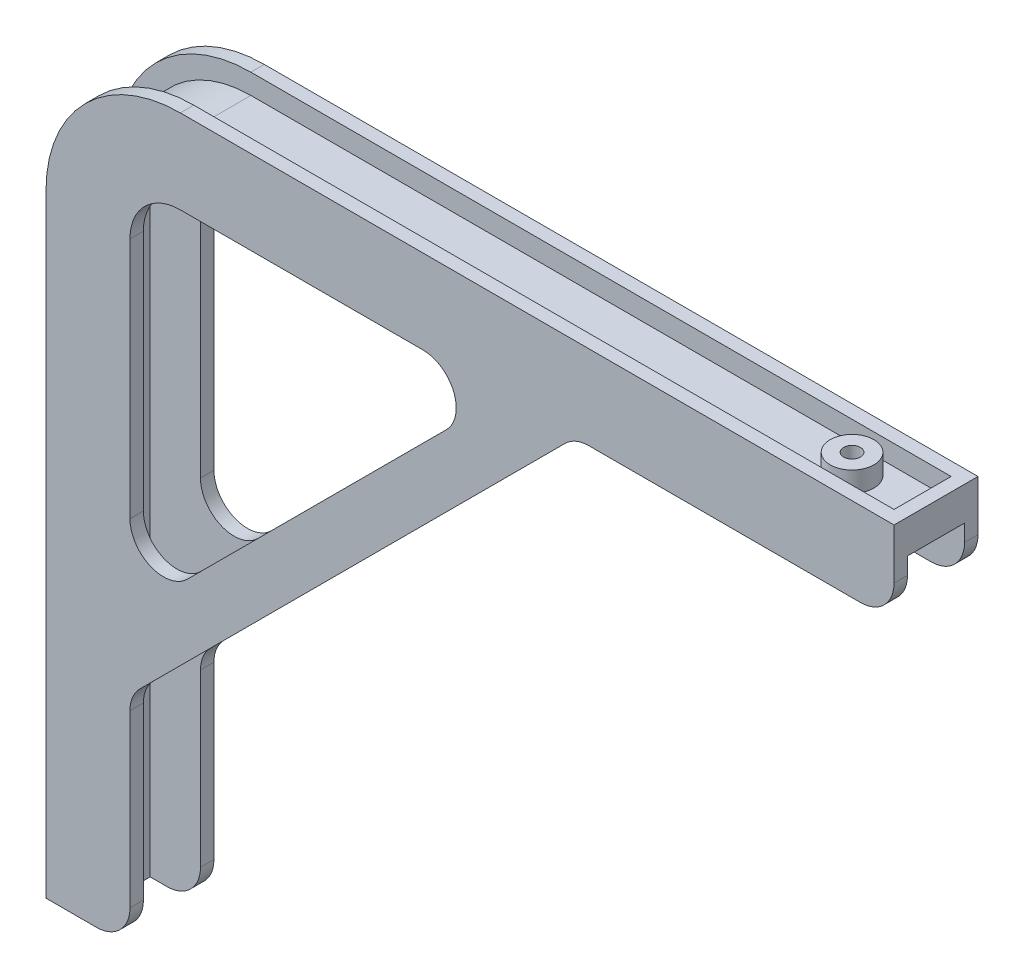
ISO-10303-21;
HEADER;
FILE_DESCRIPTION(('STEP AP214'),'2;1');
FILE_NAME('part.step','',(''),(''),'','','');
FILE_SCHEMA(('AUTOMOTIVE_DESIGN { 1 0 10303 214 1 1 1 1 }'));
ENDSEC;
DATA;
#1=APPLICATION_CONTEXT('core data for automotive mechanical design processes');
#2=APPLICATION_PROTOCOL_DEFINITION('international standard','automotive_design',2000,#1);
#3=PRODUCT_CONTEXT('',#1,'mechanical');
#4=PRODUCT('Part','Part','',(#3));
#5=PRODUCT_RELATED_PRODUCT_CATEGORY('part','',(#4));
#6=PRODUCT_DEFINITION_FORMATION('','',#4);
#7=PRODUCT_DEFINITION_CONTEXT('part definition',#1,'design');
#8=PRODUCT_DEFINITION('design','',#6,#7);
#9=PRODUCT_DEFINITION_SHAPE('','',#8);
#10=(LENGTH_UNIT() NAMED_UNIT(*) SI_UNIT(.MILLI.,.METRE.));
#11=(NAMED_UNIT(*) PLANE_ANGLE_UNIT() SI_UNIT($,.RADIAN.));
#12=(NAMED_UNIT(*) SI_UNIT($,.STERADIAN.) SOLID_ANGLE_UNIT());
#13=UNCERTAINTY_MEASURE_WITH_UNIT(LENGTH_MEASURE(1.E-05),#10,'distance_accuracy_value','');
#14=(GEOMETRIC_REPRESENTATION_CONTEXT(3) GLOBAL_UNCERTAINTY_ASSIGNED_CONTEXT((#13)) GLOBAL_UNIT_ASSIGNED_CONTEXT((#10,
#11,#12)) REPRESENTATION_CONTEXT('',''));
#15=CARTESIAN_POINT('',(0.,0.,0.));
#16=DIRECTION('',(0.,0.,1.));
#17=DIRECTION('',(1.,0.,0.));
#18=AXIS2_PLACEMENT_3D('',#15,#16,#17);
#19=CARTESIAN_POINT('',(-242.5,-30.0000000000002,12.5));
#20=DIRECTION('',(-1.,0.,0.));
#21=DIRECTION('',(0.,-1.,0.));
#22=AXIS2_PLACEMENT_3D('',#19,#20,#21);
#23=PLANE('',#22);
#24=CARTESIAN_POINT('',(-242.5,-175.,0.));
#25=DIRECTION('',(1.,0.,0.));
#26=DIRECTION('',(0.,1.,0.));
#27=AXIS2_PLACEMENT_3D('',#24,#25,#26);
#28=CIRCLE('',#27,3.);
#29=CARTESIAN_POINT('',(-242.5,-172.,0.));
#30=VERTEX_POINT('',#29);
#31=EDGE_CURVE('E632',#30,#30,#28,.T.);
#32=ORIENTED_EDGE('',*,*,#31,.F.);
#33=EDGE_LOOP('',(#32));
#34=FACE_BOUND('',#33,.T.);
#35=CARTESIAN_POINT('',(-242.5,-50.,0.));
#36=DIRECTION('',(1.,0.,0.));
#37=DIRECTION('',(0.,1.,0.));
#38=AXIS2_PLACEMENT_3D('',#35,#36,#37);
#39=CIRCLE('',#38,3.);
#40=CARTESIAN_POINT('',(-242.5,-47.,0.));
#41=VERTEX_POINT('',#40);
#42=EDGE_CURVE('E638',#41,#41,#39,.T.);
#43=ORIENTED_EDGE('',*,*,#42,.F.);
#44=EDGE_LOOP('',(#43));
#45=FACE_BOUND('',#44,.T.);
#46=DIRECTION('',(0.,-1.,0.));
#47=VECTOR('',#46,1.);
#48=CARTESIAN_POINT('',(-242.5,-212.5,-8.5));
#49=LINE('',#48,#47);
#50=CARTESIAN_POINT('',(-242.5,-30.0000000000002,-8.5));
#51=VERTEX_POINT('',#50);
#52=CARTESIAN_POINT('',(-242.5,-212.5,-8.5));
#53=VERTEX_POINT('',#52);
#54=EDGE_CURVE('E46',#51,#53,#49,.T.);
#55=ORIENTED_EDGE('',*,*,#54,.F.);
#56=DIRECTION('',(0.,0.,-1.));
#57=VECTOR('',#56,1.);
#58=CARTESIAN_POINT('',(-242.5,-30.0000000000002,12.5));
#59=LINE('',#58,#57);
#60=CARTESIAN_POINT('',(-242.5,-30.0000000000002,8.5));
#61=VERTEX_POINT('',#60);
#62=EDGE_CURVE('E675',#61,#51,#59,.T.);
#63=ORIENTED_EDGE('',*,*,#62,.F.);
#64=DIRECTION('',(0.,-1.,0.));
#65=VECTOR('',#64,1.);
#66=CARTESIAN_POINT('',(-242.5,-212.5,8.5));
#67=LINE('',#66,#65);
#68=CARTESIAN_POINT('',(-242.5,-212.5,8.5));
#69=VERTEX_POINT('',#68);
#70=EDGE_CURVE('E486',#61,#69,#67,.T.);
#71=ORIENTED_EDGE('',*,*,#70,.T.);
#72=DIRECTION('',(0.,0.,-1.));
#73=VECTOR('',#72,1.);
#74=CARTESIAN_POINT('',(-242.5,-212.5,12.5));
#75=LINE('',#74,#73);
#76=EDGE_CURVE('E677',#69,#53,#75,.T.);
#77=ORIENTED_EDGE('',*,*,#76,.T.);
#78=EDGE_LOOP('',(#55,#63,#71,#77));
#79=FACE_BOUND('',#78,.T.);
#80=ADVANCED_FACE('F31',(#34,#45,#79),#23,.F.);
#81=CARTESIAN_POINT('',(-212.5,-30.,12.5));
#82=DIRECTION('',(0.,0.,-1.));
#83=DIRECTION('',(-1.,0.,0.));
#84=AXIS2_PLACEMENT_3D('',#81,#82,#83);
#85=CYLINDRICAL_SURFACE('',#84,30.);
#86=CARTESIAN_POINT('',(-212.5,-30.,-8.5));
#87=DIRECTION('',(0.,0.,1.));
#88=DIRECTION('',(1.,0.,0.));
#89=AXIS2_PLACEMENT_3D('',#86,#87,#88);
#90=CIRCLE('',#89,30.);
#91=CARTESIAN_POINT('',(-212.5,0.,-8.5));
#92=VERTEX_POINT('',#91);
#93=EDGE_CURVE('E53',#92,#51,#90,.T.);
#94=ORIENTED_EDGE('',*,*,#93,.F.);
#95=DIRECTION('',(0.,0.,-1.));
#96=VECTOR('',#95,1.);
#97=CARTESIAN_POINT('',(-212.5,0.,12.5));
#98=LINE('',#97,#96);
#99=CARTESIAN_POINT('',(-212.5,0.,8.5));
#100=VERTEX_POINT('',#99);
#101=EDGE_CURVE('E673',#100,#92,#98,.T.);
#102=ORIENTED_EDGE('',*,*,#101,.F.);
#103=CARTESIAN_POINT('',(-212.5,-30.,8.5));
#104=DIRECTION('',(0.,0.,1.));
#105=DIRECTION('',(1.,0.,0.));
#106=AXIS2_PLACEMENT_3D('',#103,#104,#105);
#107=CIRCLE('',#106,30.);
#108=EDGE_CURVE('E483',#100,#61,#107,.T.);
#109=ORIENTED_EDGE('',*,*,#108,.T.);
#110=ORIENTED_EDGE('',*,*,#62,.T.);
#111=EDGE_LOOP('',(#94,#102,#109,#110));
#112=FACE_BOUND('',#111,.T.);
#113=ADVANCED_FACE('F761',(#112),#85,.F.);
#114=CARTESIAN_POINT('',(0.,0.,12.5));
#115=DIRECTION('',(0.,1.,0.));
#116=DIRECTION('',(-1.,0.,0.));
#117=AXIS2_PLACEMENT_3D('',#114,#115,#116);
#118=PLANE('',#117);
#119=CARTESIAN_POINT('',(-25.,0.,0.));
#120=DIRECTION('',(0.,-1.,0.));
#121=DIRECTION('',(1.,0.,0.));
#122=AXIS2_PLACEMENT_3D('',#119,#120,#121);
#123=CIRCLE('',#122,2.5);
#124=CARTESIAN_POINT('',(-22.5,0.,0.));
#125=VERTEX_POINT('',#124);
#126=EDGE_CURVE('E609',#125,#125,#123,.T.);
#127=ORIENTED_EDGE('',*,*,#126,.F.);
#128=EDGE_LOOP('',(#127));
#129=FACE_BOUND('',#128,.T.);
#130=DIRECTION('',(-1.,0.,0.));
#131=VECTOR('',#130,1.);
#132=CARTESIAN_POINT('',(-212.5,0.,-8.5));
#133=LINE('',#132,#131);
#134=CARTESIAN_POINT('',(0.,0.,-8.5));
#135=VERTEX_POINT('',#134);
#136=EDGE_CURVE('E373',#135,#92,#133,.T.);
#137=ORIENTED_EDGE('',*,*,#136,.F.);
#138=DIRECTION('',(0.,0.,-1.));
#139=VECTOR('',#138,1.);
#140=CARTESIAN_POINT('',(0.,0.,12.5));
#141=LINE('',#140,#139);
#142=CARTESIAN_POINT('',(0.,0.,8.5));
#143=VERTEX_POINT('',#142);
#144=EDGE_CURVE('E659',#143,#135,#141,.T.);
#145=ORIENTED_EDGE('',*,*,#144,.F.);
#146=DIRECTION('',(-1.,0.,0.));
#147=VECTOR('',#146,1.);
#148=CARTESIAN_POINT('',(-212.5,0.,8.5));
#149=LINE('',#148,#147);
#150=EDGE_CURVE('E516',#143,#100,#149,.T.);
#151=ORIENTED_EDGE('',*,*,#150,.T.);
#152=ORIENTED_EDGE('',*,*,#101,.T.);
#153=EDGE_LOOP('',(#137,#145,#151,#152));
#154=FACE_BOUND('',#153,.T.);
#155=ADVANCED_FACE('F767',(#129,#154),#118,.F.);
#156=CARTESIAN_POINT('',(-212.5,10.,12.5));
#157=DIRECTION('',(0.,-1.,0.));
#158=DIRECTION('',(0.,0.,-1.));
#159=AXIS2_PLACEMENT_3D('',#156,#157,#158);
#160=PLANE('',#159);
#161=CARTESIAN_POINT('',(-25.,10.,0.));
#162=DIRECTION('',(0.,-1.,0.));
#163=DIRECTION('',(1.,0.,0.));
#164=AXIS2_PLACEMENT_3D('',#161,#162,#163);
#165=CIRCLE('',#164,2.5);
#166=CARTESIAN_POINT('',(-22.5,10.,0.));
#167=VERTEX_POINT('',#166);
#168=EDGE_CURVE('E629',#167,#167,#165,.T.);
#169=ORIENTED_EDGE('',*,*,#168,.T.);
#170=EDGE_LOOP('',(#169));
#171=FACE_BOUND('',#170,.T.);
#172=CARTESIAN_POINT('',(-25.,10.,0.));
#173=DIRECTION('',(0.,-1.,0.));
#174=DIRECTION('',(0.,0.,-1.));
#175=AXIS2_PLACEMENT_3D('',#172,#173,#174);
#176=CIRCLE('',#175,6.5);
#177=CARTESIAN_POINT('',(-25.,10.,-6.5));
#178=VERTEX_POINT('',#177);
#179=EDGE_CURVE('E574',#178,#178,#176,.T.);
#180=ORIENTED_EDGE('',*,*,#179,.F.);
#181=EDGE_LOOP('',(#180));
#182=FACE_BOUND('',#181,.T.);
#183=ADVANCED_FACE('F781',(#171,#182),#160,.F.);
#184=DIRECTION('',(-1.,0.,0.));
#185=VECTOR('',#184,1.);
#186=CARTESIAN_POINT('',(-212.5,10.,-8.5));
#187=LINE('',#186,#185);
#188=CARTESIAN_POINT('',(-3.99999999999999,10.,-8.5));
#189=VERTEX_POINT('',#188);
#190=CARTESIAN_POINT('',(-212.5,9.99999999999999,-8.5));
#191=VERTEX_POINT('',#190);
#192=EDGE_CURVE('E560',#189,#191,#187,.T.);
#193=ORIENTED_EDGE('',*,*,#192,.F.);
#194=DIRECTION('',(0.,0.,-1.));
#195=VECTOR('',#194,1.);
#196=CARTESIAN_POINT('',(-4.,10.,12.5));
#197=LINE('',#196,#195);
#198=CARTESIAN_POINT('',(-3.99999999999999,10.,8.5));
#199=VERTEX_POINT('',#198);
#200=EDGE_CURVE('E607',#199,#189,#197,.T.);
#201=ORIENTED_EDGE('',*,*,#200,.F.);
#202=DIRECTION('',(-1.,0.,0.));
#203=VECTOR('',#202,1.);
#204=CARTESIAN_POINT('',(-212.5,10.,8.5));
#205=LINE('',#204,#203);
#206=CARTESIAN_POINT('',(-212.5,9.99999999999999,8.5));
#207=VERTEX_POINT('',#206);
#208=EDGE_CURVE('E565',#199,#207,#205,.T.);
#209=ORIENTED_EDGE('',*,*,#208,.T.);
#210=DIRECTION('',(0.,0.,-1.));
#211=VECTOR('',#210,1.);
#212=CARTESIAN_POINT('',(-212.5,9.99999999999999,12.5));
#213=LINE('',#212,#211);
#214=CARTESIAN_POINT('',(-212.5,9.99999999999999,12.5));
#215=VERTEX_POINT('',#214);
#216=EDGE_CURVE('E39',#215,#207,#213,.T.);
#217=ORIENTED_EDGE('',*,*,#216,.F.);
#218=DIRECTION('',(-1.,0.,0.));
#219=VECTOR('',#218,1.);
#220=CARTESIAN_POINT('',(-212.5,10.,12.5));
#221=LINE('',#220,#219);
#222=CARTESIAN_POINT('',(0.,10.,12.5));
#223=VERTEX_POINT('',#222);
#224=EDGE_CURVE('E650',#223,#215,#221,.T.);
#225=ORIENTED_EDGE('',*,*,#224,.F.);
#226=DIRECTION('',(0.,0.,-1.));
#227=VECTOR('',#226,1.);
#228=CARTESIAN_POINT('',(0.,10.,12.5));
#229=LINE('',#228,#227);
#230=CARTESIAN_POINT('',(0.,10.,-12.5));
#231=VERTEX_POINT('',#230);
#232=EDGE_CURVE('E11',#223,#231,#229,.T.);
#233=ORIENTED_EDGE('',*,*,#232,.T.);
#234=DIRECTION('',(-1.,0.,0.));
#235=VECTOR('',#234,1.);
#236=CARTESIAN_POINT('',(-212.5,10.,-12.5));
#237=LINE('',#236,#235);
#238=CARTESIAN_POINT('',(-212.5,9.99999999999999,-12.5));
#239=VERTEX_POINT('',#238);
#240=EDGE_CURVE('E662',#231,#239,#237,.T.);
#241=ORIENTED_EDGE('',*,*,#240,.T.);
#242=EDGE_CURVE('E685',#191,#239,#213,.T.);
#243=ORIENTED_EDGE('',*,*,#242,.F.);
#244=EDGE_LOOP('',(#193,#201,#209,#217,#225,#233,#241,#243));
#245=FACE_BOUND('',#244,.T.);
#246=ADVANCED_FACE('F699',(#245),#160,.F.);
#247=CARTESIAN_POINT('',(-212.5,-30.,12.5));
#248=DIRECTION('',(0.,0.,-1.));
#249=DIRECTION('',(-1.,0.,0.));
#250=AXIS2_PLACEMENT_3D('',#247,#248,#249);
#251=CYLINDRICAL_SURFACE('',#250,40.);
#252=CARTESIAN_POINT('',(-212.5,-30.,-8.5));
#253=DIRECTION('',(0.,0.,-1.));
#254=DIRECTION('',(-1.,0.,0.));
#255=AXIS2_PLACEMENT_3D('',#252,#253,#254);
#256=CIRCLE('',#255,40.);
#257=CARTESIAN_POINT('',(-252.5,-30.0000000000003,-8.5));
#258=VERTEX_POINT('',#257);
#259=EDGE_CURVE('E611',#191,#258,#256,.F.);
#260=ORIENTED_EDGE('',*,*,#259,.F.);
#261=ORIENTED_EDGE('',*,*,#242,.T.);
#262=CARTESIAN_POINT('',(-212.5,-30.,-12.5));
#263=DIRECTION('',(0.,0.,1.));
#264=DIRECTION('',(-1.,0.,0.));
#265=AXIS2_PLACEMENT_3D('',#262,#263,#264);
#266=CIRCLE('',#265,40.);
#267=CARTESIAN_POINT('',(-252.5,-30.0000000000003,-12.5));
#268=VERTEX_POINT('',#267);
#269=EDGE_CURVE('E665',#239,#268,#266,.T.);
#270=ORIENTED_EDGE('',*,*,#269,.T.);
#271=DIRECTION('',(0.,0.,-1.));
#272=VECTOR('',#271,1.);
#273=CARTESIAN_POINT('',(-252.5,-30.0000000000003,12.5));
#274=LINE('',#273,#272);
#275=EDGE_CURVE('E682',#258,#268,#274,.T.);
#276=ORIENTED_EDGE('',*,*,#275,.F.);
#277=EDGE_LOOP('',(#260,#261,#270,#276));
#278=FACE_BOUND('',#277,.T.);
#279=ADVANCED_FACE('F693',(#278),#251,.T.);
#280=CARTESIAN_POINT('',(-252.5,-212.5,12.5));
#281=DIRECTION('',(1.,0.,0.));
#282=DIRECTION('',(0.,0.,-1.));
#283=AXIS2_PLACEMENT_3D('',#280,#281,#282);
#284=PLANE('',#283);
#285=CARTESIAN_POINT('',(-252.5,-175.,0.));
#286=DIRECTION('',(1.,0.,0.));
#287=DIRECTION('',(0.,1.,0.));
#288=AXIS2_PLACEMENT_3D('',#285,#286,#287);
#289=CIRCLE('',#288,3.);
#290=CARTESIAN_POINT('',(-252.5,-172.,0.));
#291=VERTEX_POINT('',#290);
#292=EDGE_CURVE('E635',#291,#291,#289,.T.);
#293=ORIENTED_EDGE('',*,*,#292,.T.);
#294=EDGE_LOOP('',(#293));
#295=FACE_BOUND('',#294,.T.);
#296=CARTESIAN_POINT('',(-252.5,-175.,0.));
#297=DIRECTION('',(1.,0.,0.));
#298=DIRECTION('',(0.,0.,-1.));
#299=AXIS2_PLACEMENT_3D('',#296,#297,#298);
#300=CIRCLE('',#299,7.);
#301=CARTESIAN_POINT('',(-252.5,-175.,-7.));
#302=VERTEX_POINT('',#301);
#303=EDGE_CURVE('E592',#302,#302,#300,.T.);
#304=ORIENTED_EDGE('',*,*,#303,.F.);
#305=EDGE_LOOP('',(#304));
#306=FACE_BOUND('',#305,.T.);
#307=ADVANCED_FACE('F775',(#295,#306),#284,.F.);
#308=CARTESIAN_POINT('',(-252.5,-50.,0.));
#309=DIRECTION('',(1.,0.,0.));
#310=DIRECTION('',(0.,1.,0.));
#311=AXIS2_PLACEMENT_3D('',#308,#309,#310);
#312=CIRCLE('',#311,3.);
#313=CARTESIAN_POINT('',(-252.5,-47.,0.));
#314=VERTEX_POINT('',#313);
#315=EDGE_CURVE('E641',#314,#314,#312,.T.);
#316=ORIENTED_EDGE('',*,*,#315,.T.);
#317=EDGE_LOOP('',(#316));
#318=FACE_BOUND('',#317,.T.);
#319=CARTESIAN_POINT('',(-252.5,-50.,0.));
#320=DIRECTION('',(1.,0.,0.));
#321=DIRECTION('',(0.,0.,-1.));
#322=AXIS2_PLACEMENT_3D('',#319,#320,#321);
#323=CIRCLE('',#322,7.);
#324=CARTESIAN_POINT('',(-252.5,-50.,-7.));
#325=VERTEX_POINT('',#324);
#326=EDGE_CURVE('E561',#325,#325,#323,.T.);
#327=ORIENTED_EDGE('',*,*,#326,.F.);
#328=EDGE_LOOP('',(#327));
#329=FACE_BOUND('',#328,.T.);
#330=ADVANCED_FACE('F778',(#318,#329),#284,.F.);
#331=DIRECTION('',(0.,-1.,0.));
#332=VECTOR('',#331,1.);
#333=CARTESIAN_POINT('',(-252.5,-30.,-8.5));
#334=LINE('',#333,#332);
#335=CARTESIAN_POINT('',(-252.5,-208.5,-8.5));
#336=VERTEX_POINT('',#335);
#337=EDGE_CURVE('E604',#258,#336,#334,.T.);
#338=ORIENTED_EDGE('',*,*,#337,.F.);
#339=ORIENTED_EDGE('',*,*,#275,.T.);
#340=DIRECTION('',(0.,-1.,0.));
#341=VECTOR('',#340,1.);
#342=CARTESIAN_POINT('',(-252.5,-212.5,-12.5));
#343=LINE('',#342,#341);
#344=CARTESIAN_POINT('',(-252.5,-212.5,-12.5));
#345=VERTEX_POINT('',#344);
#346=EDGE_CURVE('E668',#268,#345,#343,.T.);
#347=ORIENTED_EDGE('',*,*,#346,.T.);
#348=DIRECTION('',(0.,0.,-1.));
#349=VECTOR('',#348,1.);
#350=CARTESIAN_POINT('',(-252.5,-212.5,12.5));
#351=LINE('',#350,#349);
#352=CARTESIAN_POINT('',(-252.5,-212.5,12.5));
#353=VERTEX_POINT('',#352);
#354=EDGE_CURVE('E679',#353,#345,#351,.T.);
#355=ORIENTED_EDGE('',*,*,#354,.F.);
#356=DIRECTION('',(0.,-1.,0.));
#357=VECTOR('',#356,1.);
#358=CARTESIAN_POINT('',(-252.5,-212.5,12.5));
#359=LINE('',#358,#357);
#360=CARTESIAN_POINT('',(-252.5,-30.0000000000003,12.5));
#361=VERTEX_POINT('',#360);
#362=EDGE_CURVE('E655',#361,#353,#359,.T.);
#363=ORIENTED_EDGE('',*,*,#362,.F.);
#364=CARTESIAN_POINT('',(-252.5,-30.0000000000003,8.5));
#365=VERTEX_POINT('',#364);
#366=EDGE_CURVE('E683',#361,#365,#274,.T.);
#367=ORIENTED_EDGE('',*,*,#366,.T.);
#368=DIRECTION('',(0.,-1.,0.));
#369=VECTOR('',#368,1.);
#370=CARTESIAN_POINT('',(-252.5,-30.,8.5));
#371=LINE('',#370,#369);
#372=CARTESIAN_POINT('',(-252.5,-208.5,8.5));
#373=VERTEX_POINT('',#372);
#374=EDGE_CURVE('E606',#365,#373,#371,.T.);
#375=ORIENTED_EDGE('',*,*,#374,.T.);
#376=DIRECTION('',(0.,0.,-1.));
#377=VECTOR('',#376,1.);
#378=CARTESIAN_POINT('',(-252.5,-208.5,12.5));
#379=LINE('',#378,#377);
#380=EDGE_CURVE('E602',#373,#336,#379,.T.);
#381=ORIENTED_EDGE('',*,*,#380,.T.);
#382=EDGE_LOOP('',(#338,#339,#347,#355,#363,#367,#375,#381));
#383=FACE_BOUND('',#382,.T.);
#384=ADVANCED_FACE('F709',(#383),#284,.F.);
#385=CARTESIAN_POINT('',(0.,10.,12.5));
#386=DIRECTION('',(-1.,0.,0.));
#387=DIRECTION('',(0.,-1.,0.));
#388=AXIS2_PLACEMENT_3D('',#385,#386,#387);
#389=PLANE('',#388);
#390=DIRECTION('',(0.,1.,0.));
#391=VECTOR('',#390,1.);
#392=CARTESIAN_POINT('',(0.,10.,-12.5));
#393=LINE('',#392,#391);
#394=CARTESIAN_POINT('',(0.,-4.99999999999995,-12.5));
#395=VERTEX_POINT('',#394);
#396=EDGE_CURVE('E644',#395,#231,#393,.T.);
#397=ORIENTED_EDGE('',*,*,#396,.T.);
#398=ORIENTED_EDGE('',*,*,#232,.F.);
#399=DIRECTION('',(0.,1.,0.));
#400=VECTOR('',#399,1.);
#401=CARTESIAN_POINT('',(0.,10.,12.5));
#402=LINE('',#401,#400);
#403=CARTESIAN_POINT('',(0.,-4.99999999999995,12.5));
#404=VERTEX_POINT('',#403);
#405=EDGE_CURVE('E647',#404,#223,#402,.T.);
#406=ORIENTED_EDGE('',*,*,#405,.F.);
#407=DIRECTION('',(0.,0.,1.));
#408=VECTOR('',#407,1.);
#409=CARTESIAN_POINT('',(0.,-4.99999999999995,8.5));
#410=LINE('',#409,#408);
#411=CARTESIAN_POINT('',(0.,-4.99999999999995,8.5));
#412=VERTEX_POINT('',#411);
#413=EDGE_CURVE('E539',#412,#404,#410,.T.);
#414=ORIENTED_EDGE('',*,*,#413,.F.);
#415=DIRECTION('',(0.,1.,0.));
#416=VECTOR('',#415,1.);
#417=CARTESIAN_POINT('',(0.,0.,8.5));
#418=LINE('',#417,#416);
#419=EDGE_CURVE('E514',#412,#143,#418,.T.);
#420=ORIENTED_EDGE('',*,*,#419,.T.);
#421=ORIENTED_EDGE('',*,*,#144,.T.);
#422=DIRECTION('',(0.,1.,0.));
#423=VECTOR('',#422,1.);
#424=CARTESIAN_POINT('',(0.,0.,-8.5));
#425=LINE('',#424,#423);
#426=CARTESIAN_POINT('',(0.,-4.99999999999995,-8.5));
#427=VERTEX_POINT('',#426);
#428=EDGE_CURVE('E377',#427,#135,#425,.T.);
#429=ORIENTED_EDGE('',*,*,#428,.F.);
#430=DIRECTION('',(0.,0.,-1.));
#431=VECTOR('',#430,1.);
#432=CARTESIAN_POINT('',(0.,-4.99999999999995,-8.5));
#433=LINE('',#432,#431);
#434=EDGE_CURVE('E397',#427,#395,#433,.T.);
#435=ORIENTED_EDGE('',*,*,#434,.T.);
#436=EDGE_LOOP('',(#397,#398,#406,#414,#420,#421,#429,#435));
#437=FACE_BOUND('',#436,.T.);
#438=ADVANCED_FACE('F33',(#437),#389,.F.);
#439=ORIENTED_EDGE('',*,*,#216,.T.);
#440=CARTESIAN_POINT('',(-212.5,-30.,8.5));
#441=DIRECTION('',(0.,0.,-1.));
#442=DIRECTION('',(-1.,0.,0.));
#443=AXIS2_PLACEMENT_3D('',#440,#441,#442);
#444=CIRCLE('',#443,40.);
#445=EDGE_CURVE('E618',#207,#365,#444,.F.);
#446=ORIENTED_EDGE('',*,*,#445,.T.);
#447=ORIENTED_EDGE('',*,*,#366,.F.);
#448=CARTESIAN_POINT('',(-212.5,-30.,12.5));
#449=DIRECTION('',(0.,0.,1.));
#450=DIRECTION('',(-1.,0.,0.));
#451=AXIS2_PLACEMENT_3D('',#448,#449,#450);
#452=CIRCLE('',#451,40.);
#453=EDGE_CURVE('E653',#215,#361,#452,.T.);
#454=ORIENTED_EDGE('',*,*,#453,.F.);
#455=EDGE_LOOP('',(#439,#446,#447,#454));
#456=FACE_BOUND('',#455,.T.);
#457=ADVANCED_FACE('F720',(#456),#251,.T.);
#458=CARTESIAN_POINT('',(-242.5,-212.5,12.5));
#459=DIRECTION('',(0.,1.,0.));
#460=DIRECTION('',(0.,0.,1.));
#461=AXIS2_PLACEMENT_3D('',#458,#459,#460);
#462=PLANE('',#461);
#463=DIRECTION('',(1.,0.,0.));
#464=VECTOR('',#463,1.);
#465=CARTESIAN_POINT('',(-242.5,-212.5,-12.5));
#466=LINE('',#465,#464);
#467=CARTESIAN_POINT('',(-237.5,-212.5,-12.5));
#468=VERTEX_POINT('',#467);
#469=EDGE_CURVE('E651',#345,#468,#466,.T.);
#470=ORIENTED_EDGE('',*,*,#469,.T.);
#471=DIRECTION('',(0.,0.,-1.));
#472=VECTOR('',#471,1.);
#473=CARTESIAN_POINT('',(-237.5,-212.5,-8.5));
#474=LINE('',#473,#472);
#475=CARTESIAN_POINT('',(-237.5,-212.5,-8.5));
#476=VERTEX_POINT('',#475);
#477=EDGE_CURVE('E411',#476,#468,#474,.T.);
#478=ORIENTED_EDGE('',*,*,#477,.F.);
#479=DIRECTION('',(1.,0.,0.));
#480=VECTOR('',#479,1.);
#481=CARTESIAN_POINT('',(-242.5,-212.5,-8.5));
#482=LINE('',#481,#480);
#483=EDGE_CURVE('E394',#53,#476,#482,.T.);
#484=ORIENTED_EDGE('',*,*,#483,.F.);
#485=ORIENTED_EDGE('',*,*,#76,.F.);
#486=DIRECTION('',(1.,0.,0.));
#487=VECTOR('',#486,1.);
#488=CARTESIAN_POINT('',(-242.5,-212.5,8.5));
#489=LINE('',#488,#487);
#490=CARTESIAN_POINT('',(-237.5,-212.5,8.5));
#491=VERTEX_POINT('',#490);
#492=EDGE_CURVE('E490',#69,#491,#489,.T.);
#493=ORIENTED_EDGE('',*,*,#492,.T.);
#494=DIRECTION('',(0.,0.,1.));
#495=VECTOR('',#494,1.);
#496=CARTESIAN_POINT('',(-237.5,-212.5,8.5));
#497=LINE('',#496,#495);
#498=CARTESIAN_POINT('',(-237.5,-212.5,12.5));
#499=VERTEX_POINT('',#498);
#500=EDGE_CURVE('E519',#491,#499,#497,.T.);
#501=ORIENTED_EDGE('',*,*,#500,.T.);
#502=DIRECTION('',(1.,0.,0.));
#503=VECTOR('',#502,1.);
#504=CARTESIAN_POINT('',(-242.5,-212.5,12.5));
#505=LINE('',#504,#503);
#506=EDGE_CURVE('E657',#353,#499,#505,.T.);
#507=ORIENTED_EDGE('',*,*,#506,.F.);
#508=ORIENTED_EDGE('',*,*,#354,.T.);
#509=EDGE_LOOP('',(#470,#478,#484,#485,#493,#501,#507,#508));
#510=FACE_BOUND('',#509,.T.);
#511=ADVANCED_FACE('F713',(#510),#462,.F.);
#512=CARTESIAN_POINT('',(-212.5,-30.,12.5));
#513=DIRECTION('',(0.,0.,-1.));
#514=DIRECTION('',(-1.,0.,0.));
#515=AXIS2_PLACEMENT_3D('',#512,#513,#514);
#516=PLANE('',#515);
#517=CARTESIAN_POINT('',(-10.,-5.00000000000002,12.5));
#518=DIRECTION('',(0.,0.,1.));
#519=DIRECTION('',(1.,0.,0.));
#520=AXIS2_PLACEMENT_3D('',#517,#518,#519);
#521=CIRCLE('',#520,10.);
#522=CARTESIAN_POINT('',(-10.0000000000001,-15.,12.5));
#523=VERTEX_POINT('',#522);
#524=EDGE_CURVE('E487',#523,#404,#521,.T.);
#525=ORIENTED_EDGE('',*,*,#524,.T.);
#526=ORIENTED_EDGE('',*,*,#405,.T.);
#527=ORIENTED_EDGE('',*,*,#224,.T.);
#528=ORIENTED_EDGE('',*,*,#453,.T.);
#529=ORIENTED_EDGE('',*,*,#362,.T.);
#530=ORIENTED_EDGE('',*,*,#506,.T.);
#531=CARTESIAN_POINT('',(-237.5,-202.5,12.5));
#532=DIRECTION('',(0.,0.,1.));
#533=DIRECTION('',(1.,0.,0.));
#534=AXIS2_PLACEMENT_3D('',#531,#532,#533);
#535=CIRCLE('',#534,10.);
#536=CARTESIAN_POINT('',(-227.5,-202.5,12.5));
#537=VERTEX_POINT('',#536);
#538=EDGE_CURVE('E472',#499,#537,#535,.T.);
#539=ORIENTED_EDGE('',*,*,#538,.T.);
#540=DIRECTION('',(0.,1.,0.));
#541=VECTOR('',#540,1.);
#542=CARTESIAN_POINT('',(-227.5,-202.5,12.5));
#543=LINE('',#542,#541);
#544=CARTESIAN_POINT('',(-227.5,-151.642135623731,12.5));
#545=VERTEX_POINT('',#544);
#546=EDGE_CURVE('E522',#537,#545,#543,.T.);
#547=ORIENTED_EDGE('',*,*,#546,.T.);
#548=CARTESIAN_POINT('',(-217.5,-151.642135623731,12.5));
#549=DIRECTION('',(0.,0.,-1.));
#550=DIRECTION('',(-1.,0.,0.));
#551=AXIS2_PLACEMENT_3D('',#548,#549,#550);
#552=CIRCLE('',#551,10.);
#553=CARTESIAN_POINT('',(-224.571067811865,-144.571067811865,12.5));
#554=VERTEX_POINT('',#553);
#555=EDGE_CURVE('E525',#545,#554,#552,.T.);
#556=ORIENTED_EDGE('',*,*,#555,.T.);
#557=DIRECTION('',(0.707106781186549,0.707106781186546,0.));
#558=VECTOR('',#557,1.);
#559=CARTESIAN_POINT('',(-224.571067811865,-144.571067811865,12.5));
#560=LINE('',#559,#558);
#561=CARTESIAN_POINT('',(-97.9289321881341,-17.9289321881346,12.5));
#562=VERTEX_POINT('',#561);
#563=EDGE_CURVE('E528',#554,#562,#560,.T.);
#564=ORIENTED_EDGE('',*,*,#563,.T.);
#565=CARTESIAN_POINT('',(-90.8578643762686,-25.,12.5));
#566=DIRECTION('',(0.,0.,-1.));
#567=DIRECTION('',(-1.,0.,0.));
#568=AXIS2_PLACEMENT_3D('',#565,#566,#567);
#569=CIRCLE('',#568,10.);
#570=CARTESIAN_POINT('',(-90.8578643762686,-15.,12.5));
#571=VERTEX_POINT('',#570);
#572=EDGE_CURVE('E531',#562,#571,#569,.T.);
#573=ORIENTED_EDGE('',*,*,#572,.T.);
#574=DIRECTION('',(1.,0.,0.));
#575=VECTOR('',#574,1.);
#576=CARTESIAN_POINT('',(-90.8578643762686,-15.,12.5));
#577=LINE('',#576,#575);
#578=EDGE_CURVE('E534',#571,#523,#577,.T.);
#579=ORIENTED_EDGE('',*,*,#578,.T.);
#580=EDGE_LOOP('',(#525,#526,#527,#528,#529,#530,#539,#547,#556,#564,#573,#579));
#581=FACE_BOUND('',#580,.T.);
#582=CARTESIAN_POINT('',(-212.5,-30.,12.5));
#583=DIRECTION('',(0.,0.,1.));
#584=DIRECTION('',(1.,0.,0.));
#585=AXIS2_PLACEMENT_3D('',#582,#583,#584);
#586=CIRCLE('',#585,15.);
#587=CARTESIAN_POINT('',(-212.5,-15.,12.5));
#588=VERTEX_POINT('',#587);
#589=CARTESIAN_POINT('',(-227.5,-30.0000000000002,12.5));
#590=VERTEX_POINT('',#589);
#591=EDGE_CURVE('E414',#588,#590,#586,.T.);
#592=ORIENTED_EDGE('',*,*,#591,.F.);
#593=DIRECTION('',(-1.,0.,0.));
#594=VECTOR('',#593,1.);
#595=CARTESIAN_POINT('',(-212.5,-15.,12.5));
#596=LINE('',#595,#594);
#597=CARTESIAN_POINT('',(-140.355339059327,-15.,12.5));
#598=VERTEX_POINT('',#597);
#599=EDGE_CURVE('E439',#598,#588,#596,.T.);
#600=ORIENTED_EDGE('',*,*,#599,.F.);
#601=CARTESIAN_POINT('',(-140.355339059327,-25.,12.5));
#602=DIRECTION('',(0.,0.,1.));
#603=DIRECTION('',(1.,0.,0.));
#604=AXIS2_PLACEMENT_3D('',#601,#602,#603);
#605=CIRCLE('',#604,10.);
#606=CARTESIAN_POINT('',(-133.284271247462,-32.0710678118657,12.5));
#607=VERTEX_POINT('',#606);
#608=EDGE_CURVE('E465',#607,#598,#605,.T.);
#609=ORIENTED_EDGE('',*,*,#608,.F.);
#610=DIRECTION('',(0.707106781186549,0.707106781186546,0.));
#611=VECTOR('',#610,1.);
#612=CARTESIAN_POINT('',(-210.428932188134,-109.215728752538,12.5));
#613=LINE('',#612,#611);
#614=CARTESIAN_POINT('',(-210.428932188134,-109.215728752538,12.5));
#615=VERTEX_POINT('',#614);
#616=EDGE_CURVE('E462',#615,#607,#613,.T.);
#617=ORIENTED_EDGE('',*,*,#616,.F.);
#618=CARTESIAN_POINT('',(-217.5,-102.144660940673,12.5));
#619=DIRECTION('',(0.,0.,1.));
#620=DIRECTION('',(1.,0.,0.));
#621=AXIS2_PLACEMENT_3D('',#618,#619,#620);
#622=CIRCLE('',#621,9.99999999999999);
#623=CARTESIAN_POINT('',(-227.5,-102.144660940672,12.5));
#624=VERTEX_POINT('',#623);
#625=EDGE_CURVE('E459',#624,#615,#622,.T.);
#626=ORIENTED_EDGE('',*,*,#625,.F.);
#627=DIRECTION('',(0.,-1.,0.));
#628=VECTOR('',#627,1.);
#629=CARTESIAN_POINT('',(-227.5,-102.144660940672,12.5));
#630=LINE('',#629,#628);
#631=EDGE_CURVE('E456',#590,#624,#630,.T.);
#632=ORIENTED_EDGE('',*,*,#631,.F.);
#633=EDGE_LOOP('',(#592,#600,#609,#617,#626,#632));
#634=FACE_BOUND('',#633,.T.);
#635=ADVANCED_FACE('F717',(#581,#634),#516,.F.);
#636=CARTESIAN_POINT('',(-212.5,-30.,-12.5));
#637=DIRECTION('',(0.,0.,-1.));
#638=DIRECTION('',(-1.,0.,0.));
#639=AXIS2_PLACEMENT_3D('',#636,#637,#638);
#640=PLANE('',#639);
#641=ORIENTED_EDGE('',*,*,#396,.F.);
#642=CARTESIAN_POINT('',(-10.,-5.00000000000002,-12.5));
#643=DIRECTION('',(0.,0.,1.));
#644=DIRECTION('',(1.,0.,0.));
#645=AXIS2_PLACEMENT_3D('',#642,#643,#644);
#646=CIRCLE('',#645,10.);
#647=CARTESIAN_POINT('',(-10.0000000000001,-15.,-12.5));
#648=VERTEX_POINT('',#647);
#649=EDGE_CURVE('E364',#648,#395,#646,.T.);
#650=ORIENTED_EDGE('',*,*,#649,.F.);
#651=DIRECTION('',(1.,0.,0.));
#652=VECTOR('',#651,1.);
#653=CARTESIAN_POINT('',(-90.8578643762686,-15.,-12.5));
#654=LINE('',#653,#652);
#655=CARTESIAN_POINT('',(-90.8578643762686,-15.,-12.5));
#656=VERTEX_POINT('',#655);
#657=EDGE_CURVE('E400',#656,#648,#654,.T.);
#658=ORIENTED_EDGE('',*,*,#657,.F.);
#659=CARTESIAN_POINT('',(-90.8578643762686,-25.,-12.5));
#660=DIRECTION('',(0.,0.,-1.));
#661=DIRECTION('',(-1.,0.,0.));
#662=AXIS2_PLACEMENT_3D('',#659,#660,#661);
#663=CIRCLE('',#662,10.);
#664=CARTESIAN_POINT('',(-97.9289321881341,-17.9289321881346,-12.5));
#665=VERTEX_POINT('',#664);
#666=EDGE_CURVE('E402',#665,#656,#663,.T.);
#667=ORIENTED_EDGE('',*,*,#666,.F.);
#668=DIRECTION('',(0.707106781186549,0.707106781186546,0.));
#669=VECTOR('',#668,1.);
#670=CARTESIAN_POINT('',(-224.571067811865,-144.571067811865,-12.5));
#671=LINE('',#670,#669);
#672=CARTESIAN_POINT('',(-224.571067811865,-144.571067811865,-12.5));
#673=VERTEX_POINT('',#672);
#674=EDGE_CURVE('E404',#673,#665,#671,.T.);
#675=ORIENTED_EDGE('',*,*,#674,.F.);
#676=CARTESIAN_POINT('',(-217.5,-151.642135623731,-12.5));
#677=DIRECTION('',(0.,0.,-1.));
#678=DIRECTION('',(-1.,0.,0.));
#679=AXIS2_PLACEMENT_3D('',#676,#677,#678);
#680=CIRCLE('',#679,10.);
#681=CARTESIAN_POINT('',(-227.5,-151.642135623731,-12.5));
#682=VERTEX_POINT('',#681);
#683=EDGE_CURVE('E406',#682,#673,#680,.T.);
#684=ORIENTED_EDGE('',*,*,#683,.F.);
#685=DIRECTION('',(0.,1.,0.));
#686=VECTOR('',#685,1.);
#687=CARTESIAN_POINT('',(-227.5,-202.5,-12.5));
#688=LINE('',#687,#686);
#689=CARTESIAN_POINT('',(-227.5,-202.5,-12.5));
#690=VERTEX_POINT('',#689);
#691=EDGE_CURVE('E408',#690,#682,#688,.T.);
#692=ORIENTED_EDGE('',*,*,#691,.F.);
#693=CARTESIAN_POINT('',(-237.5,-202.5,-12.5));
#694=DIRECTION('',(0.,0.,1.));
#695=DIRECTION('',(1.,0.,0.));
#696=AXIS2_PLACEMENT_3D('',#693,#694,#695);
#697=CIRCLE('',#696,10.);
#698=EDGE_CURVE('E374',#468,#690,#697,.T.);
#699=ORIENTED_EDGE('',*,*,#698,.F.);
#700=ORIENTED_EDGE('',*,*,#469,.F.);
#701=ORIENTED_EDGE('',*,*,#346,.F.);
#702=ORIENTED_EDGE('',*,*,#269,.F.);
#703=ORIENTED_EDGE('',*,*,#240,.F.);
#704=EDGE_LOOP('',(#641,#650,#658,#667,#675,#684,#692,#699,#700,#701,#702,#703));
#705=FACE_BOUND('',#704,.T.);
#706=DIRECTION('',(-1.,0.,0.));
#707=VECTOR('',#706,1.);
#708=CARTESIAN_POINT('',(-212.5,-15.,-12.5));
#709=LINE('',#708,#707);
#710=CARTESIAN_POINT('',(-140.355339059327,-15.,-12.5));
#711=VERTEX_POINT('',#710);
#712=CARTESIAN_POINT('',(-212.5,-15.,-12.5));
#713=VERTEX_POINT('',#712);
#714=EDGE_CURVE('E352',#711,#713,#709,.T.);
#715=ORIENTED_EDGE('',*,*,#714,.T.);
#716=CARTESIAN_POINT('',(-212.5,-30.,-12.5));
#717=DIRECTION('',(0.,0.,1.));
#718=DIRECTION('',(1.,0.,0.));
#719=AXIS2_PLACEMENT_3D('',#716,#717,#718);
#720=CIRCLE('',#719,15.);
#721=CARTESIAN_POINT('',(-227.5,-30.0000000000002,-12.5));
#722=VERTEX_POINT('',#721);
#723=EDGE_CURVE('E333',#713,#722,#720,.T.);
#724=ORIENTED_EDGE('',*,*,#723,.T.);
#725=DIRECTION('',(0.,-1.,0.));
#726=VECTOR('',#725,1.);
#727=CARTESIAN_POINT('',(-227.5,-102.144660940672,-12.5));
#728=LINE('',#727,#726);
#729=CARTESIAN_POINT('',(-227.5,-102.144660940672,-12.5));
#730=VERTEX_POINT('',#729);
#731=EDGE_CURVE('E339',#722,#730,#728,.T.);
#732=ORIENTED_EDGE('',*,*,#731,.T.);
#733=CARTESIAN_POINT('',(-217.5,-102.144660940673,-12.5));
#734=DIRECTION('',(0.,0.,1.));
#735=DIRECTION('',(1.,0.,0.));
#736=AXIS2_PLACEMENT_3D('',#733,#734,#735);
#737=CIRCLE('',#736,9.99999999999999);
#738=CARTESIAN_POINT('',(-210.428932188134,-109.215728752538,-12.5));
#739=VERTEX_POINT('',#738);
#740=EDGE_CURVE('E342',#730,#739,#737,.T.);
#741=ORIENTED_EDGE('',*,*,#740,.T.);
#742=DIRECTION('',(0.707106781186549,0.707106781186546,0.));
#743=VECTOR('',#742,1.);
#744=CARTESIAN_POINT('',(-210.428932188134,-109.215728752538,-12.5));
#745=LINE('',#744,#743);
#746=CARTESIAN_POINT('',(-133.284271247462,-32.0710678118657,-12.5));
#747=VERTEX_POINT('',#746);
#748=EDGE_CURVE('E357',#739,#747,#745,.T.);
#749=ORIENTED_EDGE('',*,*,#748,.T.);
#750=CARTESIAN_POINT('',(-140.355339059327,-25.,-12.5));
#751=DIRECTION('',(0.,0.,1.));
#752=DIRECTION('',(1.,0.,0.));
#753=AXIS2_PLACEMENT_3D('',#750,#751,#752);
#754=CIRCLE('',#753,10.);
#755=EDGE_CURVE('E354',#747,#711,#754,.T.);
#756=ORIENTED_EDGE('',*,*,#755,.T.);
#757=EDGE_LOOP('',(#715,#724,#732,#741,#749,#756));
#758=FACE_BOUND('',#757,.T.);
#759=ADVANCED_FACE('F702',(#705,#758),#640,.T.);
#760=CARTESIAN_POINT('',(-252.5,-50.,0.));
#761=DIRECTION('',(1.,0.,0.));
#762=DIRECTION('',(0.,1.,0.));
#763=AXIS2_PLACEMENT_3D('',#760,#761,#762);
#764=CYLINDRICAL_SURFACE('',#763,3.);
#765=ORIENTED_EDGE('',*,*,#315,.F.);
#766=EDGE_LOOP('',(#765));
#767=FACE_BOUND('',#766,.T.);
#768=ORIENTED_EDGE('',*,*,#42,.T.);
#769=EDGE_LOOP('',(#768));
#770=FACE_BOUND('',#769,.T.);
#771=ADVANCED_FACE('F825',(#767,#770),#764,.F.);
#772=CARTESIAN_POINT('',(-252.5,-175.,0.));
#773=DIRECTION('',(1.,0.,0.));
#774=DIRECTION('',(0.,1.,0.));
#775=AXIS2_PLACEMENT_3D('',#772,#773,#774);
#776=CYLINDRICAL_SURFACE('',#775,3.);
#777=ORIENTED_EDGE('',*,*,#292,.F.);
#778=EDGE_LOOP('',(#777));
#779=FACE_BOUND('',#778,.T.);
#780=ORIENTED_EDGE('',*,*,#31,.T.);
#781=EDGE_LOOP('',(#780));
#782=FACE_BOUND('',#781,.T.);
#783=ADVANCED_FACE('F821',(#779,#782),#776,.F.);
#784=CARTESIAN_POINT('',(-25.,10.,0.));
#785=DIRECTION('',(0.,-1.,0.));
#786=DIRECTION('',(1.,0.,0.));
#787=AXIS2_PLACEMENT_3D('',#784,#785,#786);
#788=CYLINDRICAL_SURFACE('',#787,2.5);
#789=ORIENTED_EDGE('',*,*,#168,.F.);
#790=EDGE_LOOP('',(#789));
#791=FACE_BOUND('',#790,.T.);
#792=ORIENTED_EDGE('',*,*,#126,.T.);
#793=EDGE_LOOP('',(#792));
#794=FACE_BOUND('',#793,.T.);
#795=ADVANCED_FACE('F758',(#791,#794),#788,.F.);
#796=CARTESIAN_POINT('',(-3.99999999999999,10.,12.5));
#797=DIRECTION('',(-1.,0.,0.));
#798=DIRECTION('',(0.,-1.,0.));
#799=AXIS2_PLACEMENT_3D('',#796,#797,#798);
#800=PLANE('',#799);
#801=DIRECTION('',(0.,1.,0.));
#802=VECTOR('',#801,1.);
#803=CARTESIAN_POINT('',(-4.00000000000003,-30.0000000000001,-8.5));
#804=LINE('',#803,#802);
#805=CARTESIAN_POINT('',(-4.,4.,-8.5));
#806=VERTEX_POINT('',#805);
#807=EDGE_CURVE('E557',#806,#189,#804,.T.);
#808=ORIENTED_EDGE('',*,*,#807,.F.);
#809=DIRECTION('',(0.,0.,-1.));
#810=VECTOR('',#809,1.);
#811=CARTESIAN_POINT('',(-4.,4.,12.5));
#812=LINE('',#811,#810);
#813=CARTESIAN_POINT('',(-4.,4.,8.5));
#814=VERTEX_POINT('',#813);
#815=EDGE_CURVE('E567',#814,#806,#812,.T.);
#816=ORIENTED_EDGE('',*,*,#815,.F.);
#817=DIRECTION('',(0.,1.,0.));
#818=VECTOR('',#817,1.);
#819=CARTESIAN_POINT('',(-4.00000000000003,-30.0000000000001,8.5));
#820=LINE('',#819,#818);
#821=EDGE_CURVE('E562',#814,#199,#820,.T.);
#822=ORIENTED_EDGE('',*,*,#821,.T.);
#823=ORIENTED_EDGE('',*,*,#200,.T.);
#824=EDGE_LOOP('',(#808,#816,#822,#823));
#825=FACE_BOUND('',#824,.T.);
#826=ADVANCED_FACE('F727',(#825),#800,.T.);
#827=CARTESIAN_POINT('',(-242.5,-208.5,12.5));
#828=DIRECTION('',(0.,1.,0.));
#829=DIRECTION('',(0.,0.,1.));
#830=AXIS2_PLACEMENT_3D('',#827,#828,#829);
#831=PLANE('',#830);
#832=DIRECTION('',(1.,0.,0.));
#833=VECTOR('',#832,1.);
#834=CARTESIAN_POINT('',(-212.5,-208.5,-8.5));
#835=LINE('',#834,#833);
#836=CARTESIAN_POINT('',(-246.5,-208.5,-8.5));
#837=VERTEX_POINT('',#836);
#838=EDGE_CURVE('E597',#336,#837,#835,.T.);
#839=ORIENTED_EDGE('',*,*,#838,.F.);
#840=ORIENTED_EDGE('',*,*,#380,.F.);
#841=DIRECTION('',(1.,0.,0.));
#842=VECTOR('',#841,1.);
#843=CARTESIAN_POINT('',(-212.5,-208.5,8.5));
#844=LINE('',#843,#842);
#845=CARTESIAN_POINT('',(-246.5,-208.5,8.5));
#846=VERTEX_POINT('',#845);
#847=EDGE_CURVE('E599',#373,#846,#844,.T.);
#848=ORIENTED_EDGE('',*,*,#847,.T.);
#849=DIRECTION('',(0.,0.,-1.));
#850=VECTOR('',#849,1.);
#851=CARTESIAN_POINT('',(-246.5,-208.5,12.5));
#852=LINE('',#851,#850);
#853=EDGE_CURVE('E588',#846,#837,#852,.T.);
#854=ORIENTED_EDGE('',*,*,#853,.T.);
#855=EDGE_LOOP('',(#839,#840,#848,#854));
#856=FACE_BOUND('',#855,.T.);
#857=ADVANCED_FACE('F748',(#856),#831,.T.);
#858=CARTESIAN_POINT('',(-246.5,-30.0000000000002,12.5));
#859=DIRECTION('',(-1.,0.,0.));
#860=DIRECTION('',(0.,-1.,0.));
#861=AXIS2_PLACEMENT_3D('',#858,#859,#860);
#862=PLANE('',#861);
#863=CARTESIAN_POINT('',(-246.5,-175.,0.));
#864=DIRECTION('',(-1.,0.,0.));
#865=DIRECTION('',(0.,-1.,0.));
#866=AXIS2_PLACEMENT_3D('',#863,#864,#865);
#867=CIRCLE('',#866,7.);
#868=CARTESIAN_POINT('',(-246.5,-182.,0.));
#869=VERTEX_POINT('',#868);
#870=EDGE_CURVE('E589',#869,#869,#867,.F.);
#871=ORIENTED_EDGE('',*,*,#870,.T.);
#872=EDGE_LOOP('',(#871));
#873=FACE_BOUND('',#872,.T.);
#874=CARTESIAN_POINT('',(-246.5,-50.,0.));
#875=DIRECTION('',(-1.,0.,0.));
#876=DIRECTION('',(0.,-1.,0.));
#877=AXIS2_PLACEMENT_3D('',#874,#875,#876);
#878=CIRCLE('',#877,7.);
#879=CARTESIAN_POINT('',(-246.5,-57.,0.));
#880=VERTEX_POINT('',#879);
#881=EDGE_CURVE('E593',#880,#880,#878,.F.);
#882=ORIENTED_EDGE('',*,*,#881,.T.);
#883=EDGE_LOOP('',(#882));
#884=FACE_BOUND('',#883,.T.);
#885=DIRECTION('',(0.,1.,0.));
#886=VECTOR('',#885,1.);
#887=CARTESIAN_POINT('',(-246.5,-30.,-8.5));
#888=LINE('',#887,#886);
#889=CARTESIAN_POINT('',(-246.5,-30.0000000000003,-8.5));
#890=VERTEX_POINT('',#889);
#891=EDGE_CURVE('E583',#837,#890,#888,.T.);
#892=ORIENTED_EDGE('',*,*,#891,.F.);
#893=ORIENTED_EDGE('',*,*,#853,.F.);
#894=DIRECTION('',(0.,1.,0.));
#895=VECTOR('',#894,1.);
#896=CARTESIAN_POINT('',(-246.5,-30.,8.5));
#897=LINE('',#896,#895);
#898=CARTESIAN_POINT('',(-246.5,-30.0000000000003,8.5));
#899=VERTEX_POINT('',#898);
#900=EDGE_CURVE('E585',#846,#899,#897,.T.);
#901=ORIENTED_EDGE('',*,*,#900,.T.);
#902=DIRECTION('',(0.,0.,-1.));
#903=VECTOR('',#902,1.);
#904=CARTESIAN_POINT('',(-246.5,-30.0000000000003,12.5));
#905=LINE('',#904,#903);
#906=EDGE_CURVE('E581',#899,#890,#905,.T.);
#907=ORIENTED_EDGE('',*,*,#906,.T.);
#908=EDGE_LOOP('',(#892,#893,#901,#907));
#909=FACE_BOUND('',#908,.T.);
#910=ADVANCED_FACE('F744',(#873,#884,#909),#862,.T.);
#911=CARTESIAN_POINT('',(-212.5,-30.,12.5));
#912=DIRECTION('',(0.,0.,-1.));
#913=DIRECTION('',(-1.,0.,0.));
#914=AXIS2_PLACEMENT_3D('',#911,#912,#913);
#915=CYLINDRICAL_SURFACE('',#914,34.);
#916=CARTESIAN_POINT('',(-212.5,-30.,-8.5));
#917=DIRECTION('',(0.,0.,-1.));
#918=DIRECTION('',(-1.,0.,0.));
#919=AXIS2_PLACEMENT_3D('',#916,#917,#918);
#920=CIRCLE('',#919,34.);
#921=CARTESIAN_POINT('',(-212.5,3.99999999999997,-8.5));
#922=VERTEX_POINT('',#921);
#923=EDGE_CURVE('E576',#890,#922,#920,.T.);
#924=ORIENTED_EDGE('',*,*,#923,.F.);
#925=ORIENTED_EDGE('',*,*,#906,.F.);
#926=CARTESIAN_POINT('',(-212.5,-30.,8.5));
#927=DIRECTION('',(0.,0.,-1.));
#928=DIRECTION('',(-1.,0.,0.));
#929=AXIS2_PLACEMENT_3D('',#926,#927,#928);
#930=CIRCLE('',#929,34.);
#931=CARTESIAN_POINT('',(-212.5,3.99999999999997,8.5));
#932=VERTEX_POINT('',#931);
#933=EDGE_CURVE('E578',#899,#932,#930,.T.);
#934=ORIENTED_EDGE('',*,*,#933,.T.);
#935=DIRECTION('',(0.,0.,1.));
#936=VECTOR('',#935,1.);
#937=CARTESIAN_POINT('',(-212.5,3.99999999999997,12.5));
#938=LINE('',#937,#936);
#939=EDGE_CURVE('E570',#932,#922,#938,.F.);
#940=ORIENTED_EDGE('',*,*,#939,.T.);
#941=EDGE_LOOP('',(#924,#925,#934,#940));
#942=FACE_BOUND('',#941,.T.);
#943=ADVANCED_FACE('F741',(#942),#915,.T.);
#944=CARTESIAN_POINT('',(0.,4.,12.5));
#945=DIRECTION('',(0.,1.,0.));
#946=DIRECTION('',(-1.,0.,0.));
#947=AXIS2_PLACEMENT_3D('',#944,#945,#946);
#948=PLANE('',#947);
#949=CARTESIAN_POINT('',(-25.,4.,0.));
#950=DIRECTION('',(0.,1.,0.));
#951=DIRECTION('',(-1.,0.,0.));
#952=AXIS2_PLACEMENT_3D('',#949,#950,#951);
#953=CIRCLE('',#952,6.5);
#954=CARTESIAN_POINT('',(-31.5,4.,0.));
#955=VERTEX_POINT('',#954);
#956=EDGE_CURVE('E542',#955,#955,#953,.F.);
#957=ORIENTED_EDGE('',*,*,#956,.T.);
#958=EDGE_LOOP('',(#957));
#959=FACE_BOUND('',#958,.T.);
#960=DIRECTION('',(1.,0.,0.));
#961=VECTOR('',#960,1.);
#962=CARTESIAN_POINT('',(-212.5,3.99999999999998,-8.5));
#963=LINE('',#962,#961);
#964=EDGE_CURVE('E566',#922,#806,#963,.T.);
#965=ORIENTED_EDGE('',*,*,#964,.F.);
#966=ORIENTED_EDGE('',*,*,#939,.F.);
#967=DIRECTION('',(1.,0.,0.));
#968=VECTOR('',#967,1.);
#969=CARTESIAN_POINT('',(-212.5,3.99999999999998,8.5));
#970=LINE('',#969,#968);
#971=EDGE_CURVE('E571',#932,#814,#970,.T.);
#972=ORIENTED_EDGE('',*,*,#971,.T.);
#973=ORIENTED_EDGE('',*,*,#815,.T.);
#974=EDGE_LOOP('',(#965,#966,#972,#973));
#975=FACE_BOUND('',#974,.T.);
#976=ADVANCED_FACE('F735',(#959,#975),#948,.T.);
#977=CARTESIAN_POINT('',(-212.5,-30.,8.5));
#978=DIRECTION('',(0.,0.,-1.));
#979=DIRECTION('',(-1.,0.,0.));
#980=AXIS2_PLACEMENT_3D('',#977,#978,#979);
#981=PLANE('',#980);
#982=ORIENTED_EDGE('',*,*,#821,.F.);
#983=ORIENTED_EDGE('',*,*,#971,.F.);
#984=ORIENTED_EDGE('',*,*,#933,.F.);
#985=ORIENTED_EDGE('',*,*,#900,.F.);
#986=ORIENTED_EDGE('',*,*,#847,.F.);
#987=ORIENTED_EDGE('',*,*,#374,.F.);
#988=ORIENTED_EDGE('',*,*,#445,.F.);
#989=ORIENTED_EDGE('',*,*,#208,.F.);
#990=EDGE_LOOP('',(#982,#983,#984,#985,#986,#987,#988,#989));
#991=FACE_BOUND('',#990,.T.);
#992=ADVANCED_FACE('F723',(#991),#981,.T.);
#993=CARTESIAN_POINT('',(-212.5,-30.,-8.5));
#994=DIRECTION('',(0.,0.,-1.));
#995=DIRECTION('',(-1.,0.,0.));
#996=AXIS2_PLACEMENT_3D('',#993,#994,#995);
#997=PLANE('',#996);
#998=ORIENTED_EDGE('',*,*,#807,.T.);
#999=ORIENTED_EDGE('',*,*,#192,.T.);
#1000=ORIENTED_EDGE('',*,*,#259,.T.);
#1001=ORIENTED_EDGE('',*,*,#337,.T.);
#1002=ORIENTED_EDGE('',*,*,#838,.T.);
#1003=ORIENTED_EDGE('',*,*,#891,.T.);
#1004=ORIENTED_EDGE('',*,*,#923,.T.);
#1005=ORIENTED_EDGE('',*,*,#964,.T.);
#1006=EDGE_LOOP('',(#998,#999,#1000,#1001,#1002,#1003,#1004,#1005));
#1007=FACE_BOUND('',#1006,.T.);
#1008=ADVANCED_FACE('F730',(#1007),#997,.F.);
#1009=CARTESIAN_POINT('',(-252.5,-50.,0.));
#1010=DIRECTION('',(1.,0.,0.));
#1011=DIRECTION('',(0.,1.,0.));
#1012=AXIS2_PLACEMENT_3D('',#1009,#1010,#1011);
#1013=CYLINDRICAL_SURFACE('',#1012,7.);
#1014=ORIENTED_EDGE('',*,*,#326,.T.);
#1015=EDGE_LOOP('',(#1014));
#1016=FACE_BOUND('',#1015,.T.);
#1017=ORIENTED_EDGE('',*,*,#881,.F.);
#1018=EDGE_LOOP('',(#1017));
#1019=FACE_BOUND('',#1018,.T.);
#1020=ADVANCED_FACE('F812',(#1016,#1019),#1013,.T.);
#1021=CARTESIAN_POINT('',(-252.5,-175.,0.));
#1022=DIRECTION('',(1.,0.,0.));
#1023=DIRECTION('',(0.,1.,0.));
#1024=AXIS2_PLACEMENT_3D('',#1021,#1022,#1023);
#1025=CYLINDRICAL_SURFACE('',#1024,7.);
#1026=ORIENTED_EDGE('',*,*,#303,.T.);
#1027=EDGE_LOOP('',(#1026));
#1028=FACE_BOUND('',#1027,.T.);
#1029=ORIENTED_EDGE('',*,*,#870,.F.);
#1030=EDGE_LOOP('',(#1029));
#1031=FACE_BOUND('',#1030,.T.);
#1032=ADVANCED_FACE('F797',(#1028,#1031),#1025,.T.);
#1033=CARTESIAN_POINT('',(-25.,10.,0.));
#1034=DIRECTION('',(0.,-1.,0.));
#1035=DIRECTION('',(1.,0.,0.));
#1036=AXIS2_PLACEMENT_3D('',#1033,#1034,#1035);
#1037=CYLINDRICAL_SURFACE('',#1036,6.5);
#1038=ORIENTED_EDGE('',*,*,#179,.T.);
#1039=EDGE_LOOP('',(#1038));
#1040=FACE_BOUND('',#1039,.T.);
#1041=ORIENTED_EDGE('',*,*,#956,.F.);
#1042=EDGE_LOOP('',(#1041));
#1043=FACE_BOUND('',#1042,.T.);
#1044=ADVANCED_FACE('F793',(#1040,#1043),#1037,.T.);
#1045=CARTESIAN_POINT('',(-10.,-5.00000000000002,8.5));
#1046=DIRECTION('',(0.,0.,1.));
#1047=DIRECTION('',(1.,0.,0.));
#1048=AXIS2_PLACEMENT_3D('',#1045,#1046,#1047);
#1049=CYLINDRICAL_SURFACE('',#1048,10.);
#1050=ORIENTED_EDGE('',*,*,#524,.F.);
#1051=DIRECTION('',(0.,0.,1.));
#1052=VECTOR('',#1051,1.);
#1053=CARTESIAN_POINT('',(-10.0000000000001,-15.,8.5));
#1054=LINE('',#1053,#1052);
#1055=CARTESIAN_POINT('',(-10.0000000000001,-15.,8.5));
#1056=VERTEX_POINT('',#1055);
#1057=EDGE_CURVE('E543',#1056,#523,#1054,.T.);
#1058=ORIENTED_EDGE('',*,*,#1057,.F.);
#1059=CARTESIAN_POINT('',(-10.,-5.00000000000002,8.5));
#1060=DIRECTION('',(0.,0.,1.));
#1061=DIRECTION('',(1.,0.,0.));
#1062=AXIS2_PLACEMENT_3D('',#1059,#1060,#1061);
#1063=CIRCLE('',#1062,10.);
#1064=EDGE_CURVE('E511',#1056,#412,#1063,.T.);
#1065=ORIENTED_EDGE('',*,*,#1064,.T.);
#1066=ORIENTED_EDGE('',*,*,#413,.T.);
#1067=EDGE_LOOP('',(#1050,#1058,#1065,#1066));
#1068=FACE_BOUND('',#1067,.T.);
#1069=ADVANCED_FACE('F796',(#1068),#1049,.T.);
#1070=CARTESIAN_POINT('',(-90.8578643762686,-15.,8.5));
#1071=DIRECTION('',(0.,-1.,0.));
#1072=DIRECTION('',(1.,0.,0.));
#1073=AXIS2_PLACEMENT_3D('',#1070,#1071,#1072);
#1074=PLANE('',#1073);
#1075=ORIENTED_EDGE('',*,*,#578,.F.);
#1076=DIRECTION('',(0.,0.,1.));
#1077=VECTOR('',#1076,1.);
#1078=CARTESIAN_POINT('',(-90.8578643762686,-15.,8.5));
#1079=LINE('',#1078,#1077);
#1080=CARTESIAN_POINT('',(-90.8578643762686,-15.,8.5));
#1081=VERTEX_POINT('',#1080);
#1082=EDGE_CURVE('E545',#1081,#571,#1079,.T.);
#1083=ORIENTED_EDGE('',*,*,#1082,.F.);
#1084=DIRECTION('',(1.,0.,0.));
#1085=VECTOR('',#1084,1.);
#1086=CARTESIAN_POINT('',(-90.8578643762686,-15.,8.5));
#1087=LINE('',#1086,#1085);
#1088=EDGE_CURVE('E508',#1081,#1056,#1087,.T.);
#1089=ORIENTED_EDGE('',*,*,#1088,.T.);
#1090=ORIENTED_EDGE('',*,*,#1057,.T.);
#1091=EDGE_LOOP('',(#1075,#1083,#1089,#1090));
#1092=FACE_BOUND('',#1091,.T.);
#1093=ADVANCED_FACE('F926',(#1092),#1074,.T.);
#1094=CARTESIAN_POINT('',(-90.8578643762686,-25.,8.5));
#1095=DIRECTION('',(0.,0.,1.));
#1096=DIRECTION('',(1.,0.,0.));
#1097=AXIS2_PLACEMENT_3D('',#1094,#1095,#1096);
#1098=CYLINDRICAL_SURFACE('',#1097,10.);
#1099=ORIENTED_EDGE('',*,*,#572,.F.);
#1100=DIRECTION('',(0.,0.,1.));
#1101=VECTOR('',#1100,1.);
#1102=CARTESIAN_POINT('',(-97.9289321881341,-17.9289321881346,8.5));
#1103=LINE('',#1102,#1101);
#1104=CARTESIAN_POINT('',(-97.9289321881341,-17.9289321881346,8.5));
#1105=VERTEX_POINT('',#1104);
#1106=EDGE_CURVE('E547',#1105,#562,#1103,.T.);
#1107=ORIENTED_EDGE('',*,*,#1106,.F.);
#1108=CARTESIAN_POINT('',(-90.8578643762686,-25.,8.5));
#1109=DIRECTION('',(0.,0.,-1.));
#1110=DIRECTION('',(-1.,0.,0.));
#1111=AXIS2_PLACEMENT_3D('',#1108,#1109,#1110);
#1112=CIRCLE('',#1111,10.);
#1113=EDGE_CURVE('E505',#1105,#1081,#1112,.T.);
#1114=ORIENTED_EDGE('',*,*,#1113,.T.);
#1115=ORIENTED_EDGE('',*,*,#1082,.T.);
#1116=EDGE_LOOP('',(#1099,#1107,#1114,#1115));
#1117=FACE_BOUND('',#1116,.T.);
#1118=ADVANCED_FACE('F936',(#1117),#1098,.F.);
#1119=CARTESIAN_POINT('',(-224.571067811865,-144.571067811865,8.5));
#1120=DIRECTION('',(0.707106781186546,-0.707106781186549,0.));
#1121=DIRECTION('',(0.707106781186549,0.707106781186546,0.));
#1122=AXIS2_PLACEMENT_3D('',#1119,#1120,#1121);
#1123=PLANE('',#1122);
#1124=ORIENTED_EDGE('',*,*,#563,.F.);
#1125=DIRECTION('',(0.,0.,1.));
#1126=VECTOR('',#1125,1.);
#1127=CARTESIAN_POINT('',(-224.571067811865,-144.571067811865,8.5));
#1128=LINE('',#1127,#1126);
#1129=CARTESIAN_POINT('',(-224.571067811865,-144.571067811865,8.5));
#1130=VERTEX_POINT('',#1129);
#1131=EDGE_CURVE('E549',#1130,#554,#1128,.T.);
#1132=ORIENTED_EDGE('',*,*,#1131,.F.);
#1133=DIRECTION('',(0.707106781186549,0.707106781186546,0.));
#1134=VECTOR('',#1133,1.);
#1135=CARTESIAN_POINT('',(-224.571067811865,-144.571067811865,8.5));
#1136=LINE('',#1135,#1134);
#1137=EDGE_CURVE('E502',#1130,#1105,#1136,.T.);
#1138=ORIENTED_EDGE('',*,*,#1137,.T.);
#1139=ORIENTED_EDGE('',*,*,#1106,.T.);
#1140=EDGE_LOOP('',(#1124,#1132,#1138,#1139));
#1141=FACE_BOUND('',#1140,.T.);
#1142=ADVANCED_FACE('F946',(#1141),#1123,.T.);
#1143=CARTESIAN_POINT('',(-217.5,-151.642135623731,8.5));
#1144=DIRECTION('',(0.,0.,1.));
#1145=DIRECTION('',(1.,0.,0.));
#1146=AXIS2_PLACEMENT_3D('',#1143,#1144,#1145);
#1147=CYLINDRICAL_SURFACE('',#1146,10.);
#1148=ORIENTED_EDGE('',*,*,#555,.F.);
#1149=DIRECTION('',(0.,0.,1.));
#1150=VECTOR('',#1149,1.);
#1151=CARTESIAN_POINT('',(-227.5,-151.642135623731,8.5));
#1152=LINE('',#1151,#1150);
#1153=CARTESIAN_POINT('',(-227.5,-151.642135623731,8.5));
#1154=VERTEX_POINT('',#1153);
#1155=EDGE_CURVE('E551',#1154,#545,#1152,.T.);
#1156=ORIENTED_EDGE('',*,*,#1155,.F.);
#1157=CARTESIAN_POINT('',(-217.5,-151.642135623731,8.5));
#1158=DIRECTION('',(0.,0.,-1.));
#1159=DIRECTION('',(-1.,0.,0.));
#1160=AXIS2_PLACEMENT_3D('',#1157,#1158,#1159);
#1161=CIRCLE('',#1160,10.);
#1162=EDGE_CURVE('E499',#1154,#1130,#1161,.T.);
#1163=ORIENTED_EDGE('',*,*,#1162,.T.);
#1164=ORIENTED_EDGE('',*,*,#1131,.T.);
#1165=EDGE_LOOP('',(#1148,#1156,#1163,#1164));
#1166=FACE_BOUND('',#1165,.T.);
#1167=ADVANCED_FACE('F956',(#1166),#1147,.F.);
#1168=CARTESIAN_POINT('',(-227.5,-202.5,8.5));
#1169=DIRECTION('',(1.,0.,0.));
#1170=DIRECTION('',(0.,1.,0.));
#1171=AXIS2_PLACEMENT_3D('',#1168,#1169,#1170);
#1172=PLANE('',#1171);
#1173=ORIENTED_EDGE('',*,*,#546,.F.);
#1174=DIRECTION('',(0.,0.,1.));
#1175=VECTOR('',#1174,1.);
#1176=CARTESIAN_POINT('',(-227.5,-202.5,8.5));
#1177=LINE('',#1176,#1175);
#1178=CARTESIAN_POINT('',(-227.5,-202.5,8.5));
#1179=VERTEX_POINT('',#1178);
#1180=EDGE_CURVE('E553',#1179,#537,#1177,.T.);
#1181=ORIENTED_EDGE('',*,*,#1180,.F.);
#1182=DIRECTION('',(0.,1.,0.));
#1183=VECTOR('',#1182,1.);
#1184=CARTESIAN_POINT('',(-227.5,-202.5,8.5));
#1185=LINE('',#1184,#1183);
#1186=EDGE_CURVE('E496',#1179,#1154,#1185,.T.);
#1187=ORIENTED_EDGE('',*,*,#1186,.T.);
#1188=ORIENTED_EDGE('',*,*,#1155,.T.);
#1189=EDGE_LOOP('',(#1173,#1181,#1187,#1188));
#1190=FACE_BOUND('',#1189,.T.);
#1191=ADVANCED_FACE('F966',(#1190),#1172,.T.);
#1192=CARTESIAN_POINT('',(-237.5,-202.5,8.5));
#1193=DIRECTION('',(0.,0.,1.));
#1194=DIRECTION('',(1.,0.,0.));
#1195=AXIS2_PLACEMENT_3D('',#1192,#1193,#1194);
#1196=CYLINDRICAL_SURFACE('',#1195,10.);
#1197=ORIENTED_EDGE('',*,*,#538,.F.);
#1198=ORIENTED_EDGE('',*,*,#500,.F.);
#1199=CARTESIAN_POINT('',(-237.5,-202.5,8.5));
#1200=DIRECTION('',(0.,0.,1.));
#1201=DIRECTION('',(1.,0.,0.));
#1202=AXIS2_PLACEMENT_3D('',#1199,#1200,#1201);
#1203=CIRCLE('',#1202,10.);
#1204=EDGE_CURVE('E493',#491,#1179,#1203,.T.);
#1205=ORIENTED_EDGE('',*,*,#1204,.T.);
#1206=ORIENTED_EDGE('',*,*,#1180,.T.);
#1207=EDGE_LOOP('',(#1197,#1198,#1205,#1206));
#1208=FACE_BOUND('',#1207,.T.);
#1209=ADVANCED_FACE('F976',(#1208),#1196,.T.);
#1210=CARTESIAN_POINT('',(-212.5,-30.,8.5));
#1211=DIRECTION('',(0.,0.,1.));
#1212=DIRECTION('',(1.,0.,0.));
#1213=AXIS2_PLACEMENT_3D('',#1210,#1211,#1212);
#1214=PLANE('',#1213);
#1215=DIRECTION('',(-1.,0.,0.));
#1216=VECTOR('',#1215,1.);
#1217=CARTESIAN_POINT('',(-212.5,-15.,8.5));
#1218=LINE('',#1217,#1216);
#1219=CARTESIAN_POINT('',(-140.355339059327,-15.,8.5));
#1220=VERTEX_POINT('',#1219);
#1221=CARTESIAN_POINT('',(-212.5,-15.,8.5));
#1222=VERTEX_POINT('',#1221);
#1223=EDGE_CURVE('E451',#1220,#1222,#1218,.T.);
#1224=ORIENTED_EDGE('',*,*,#1223,.T.);
#1225=CARTESIAN_POINT('',(-212.5,-30.,8.5));
#1226=DIRECTION('',(0.,0.,1.));
#1227=DIRECTION('',(1.,0.,0.));
#1228=AXIS2_PLACEMENT_3D('',#1225,#1226,#1227);
#1229=CIRCLE('',#1228,15.);
#1230=CARTESIAN_POINT('',(-227.5,-30.0000000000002,8.5));
#1231=VERTEX_POINT('',#1230);
#1232=EDGE_CURVE('E435',#1222,#1231,#1229,.T.);
#1233=ORIENTED_EDGE('',*,*,#1232,.T.);
#1234=DIRECTION('',(0.,-1.,0.));
#1235=VECTOR('',#1234,1.);
#1236=CARTESIAN_POINT('',(-227.5,-102.144660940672,8.5));
#1237=LINE('',#1236,#1235);
#1238=CARTESIAN_POINT('',(-227.5,-102.144660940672,8.5));
#1239=VERTEX_POINT('',#1238);
#1240=EDGE_CURVE('E438',#1231,#1239,#1237,.T.);
#1241=ORIENTED_EDGE('',*,*,#1240,.T.);
#1242=CARTESIAN_POINT('',(-217.5,-102.144660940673,8.5));
#1243=DIRECTION('',(0.,0.,1.));
#1244=DIRECTION('',(1.,0.,0.));
#1245=AXIS2_PLACEMENT_3D('',#1242,#1243,#1244);
#1246=CIRCLE('',#1245,9.99999999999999);
#1247=CARTESIAN_POINT('',(-210.428932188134,-109.215728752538,8.5));
#1248=VERTEX_POINT('',#1247);
#1249=EDGE_CURVE('E442',#1239,#1248,#1246,.T.);
#1250=ORIENTED_EDGE('',*,*,#1249,.T.);
#1251=DIRECTION('',(0.707106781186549,0.707106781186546,0.));
#1252=VECTOR('',#1251,1.);
#1253=CARTESIAN_POINT('',(-210.428932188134,-109.215728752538,8.5));
#1254=LINE('',#1253,#1252);
#1255=CARTESIAN_POINT('',(-133.284271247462,-32.0710678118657,8.5));
#1256=VERTEX_POINT('',#1255);
#1257=EDGE_CURVE('E445',#1248,#1256,#1254,.T.);
#1258=ORIENTED_EDGE('',*,*,#1257,.T.);
#1259=CARTESIAN_POINT('',(-140.355339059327,-25.,8.5));
#1260=DIRECTION('',(0.,0.,1.));
#1261=DIRECTION('',(1.,0.,0.));
#1262=AXIS2_PLACEMENT_3D('',#1259,#1260,#1261);
#1263=CIRCLE('',#1262,10.);
#1264=EDGE_CURVE('E448',#1256,#1220,#1263,.T.);
#1265=ORIENTED_EDGE('',*,*,#1264,.T.);
#1266=EDGE_LOOP('',(#1224,#1233,#1241,#1250,#1258,#1265));
#1267=FACE_BOUND('',#1266,.T.);
#1268=ORIENTED_EDGE('',*,*,#108,.F.);
#1269=ORIENTED_EDGE('',*,*,#150,.F.);
#1270=ORIENTED_EDGE('',*,*,#419,.F.);
#1271=ORIENTED_EDGE('',*,*,#1064,.F.);
#1272=ORIENTED_EDGE('',*,*,#1088,.F.);
#1273=ORIENTED_EDGE('',*,*,#1113,.F.);
#1274=ORIENTED_EDGE('',*,*,#1137,.F.);
#1275=ORIENTED_EDGE('',*,*,#1162,.F.);
#1276=ORIENTED_EDGE('',*,*,#1186,.F.);
#1277=ORIENTED_EDGE('',*,*,#1204,.F.);
#1278=ORIENTED_EDGE('',*,*,#492,.F.);
#1279=ORIENTED_EDGE('',*,*,#70,.F.);
#1280=EDGE_LOOP('',(#1268,#1269,#1270,#1271,#1272,#1273,#1274,#1275,#1276,#1277,#1278,#1279));
#1281=FACE_BOUND('',#1280,.T.);
#1282=ADVANCED_FACE('F986',(#1267,#1281),#1214,.F.);
#1283=CARTESIAN_POINT('',(-212.5,-30.,8.5));
#1284=DIRECTION('',(0.,0.,1.));
#1285=DIRECTION('',(1.,0.,0.));
#1286=AXIS2_PLACEMENT_3D('',#1283,#1284,#1285);
#1287=CYLINDRICAL_SURFACE('',#1286,15.);
#1288=ORIENTED_EDGE('',*,*,#591,.T.);
#1289=DIRECTION('',(0.,0.,1.));
#1290=VECTOR('',#1289,1.);
#1291=CARTESIAN_POINT('',(-227.5,-30.0000000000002,8.5));
#1292=LINE('',#1291,#1290);
#1293=EDGE_CURVE('E454',#1231,#590,#1292,.T.);
#1294=ORIENTED_EDGE('',*,*,#1293,.F.);
#1295=ORIENTED_EDGE('',*,*,#1232,.F.);
#1296=DIRECTION('',(0.,0.,1.));
#1297=VECTOR('',#1296,1.);
#1298=CARTESIAN_POINT('',(-212.5,-15.,8.5));
#1299=LINE('',#1298,#1297);
#1300=EDGE_CURVE('E470',#1222,#588,#1299,.T.);
#1301=ORIENTED_EDGE('',*,*,#1300,.T.);
#1302=EDGE_LOOP('',(#1288,#1294,#1295,#1301));
#1303=FACE_BOUND('',#1302,.T.);
#1304=ADVANCED_FACE('F996',(#1303),#1287,.F.);
#1305=CARTESIAN_POINT('',(-212.5,-15.,8.5));
#1306=DIRECTION('',(0.,1.,0.));
#1307=DIRECTION('',(-1.,0.,0.));
#1308=AXIS2_PLACEMENT_3D('',#1305,#1306,#1307);
#1309=PLANE('',#1308);
#1310=ORIENTED_EDGE('',*,*,#599,.T.);
#1311=ORIENTED_EDGE('',*,*,#1300,.F.);
#1312=ORIENTED_EDGE('',*,*,#1223,.F.);
#1313=DIRECTION('',(0.,0.,1.));
#1314=VECTOR('',#1313,1.);
#1315=CARTESIAN_POINT('',(-140.355339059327,-15.,8.5));
#1316=LINE('',#1315,#1314);
#1317=EDGE_CURVE('E473',#1220,#598,#1316,.T.);
#1318=ORIENTED_EDGE('',*,*,#1317,.T.);
#1319=EDGE_LOOP('',(#1310,#1311,#1312,#1318));
#1320=FACE_BOUND('',#1319,.T.);
#1321=ADVANCED_FACE('F1006',(#1320),#1309,.F.);
#1322=CARTESIAN_POINT('',(-140.355339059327,-25.,8.5));
#1323=DIRECTION('',(0.,0.,1.));
#1324=DIRECTION('',(1.,0.,0.));
#1325=AXIS2_PLACEMENT_3D('',#1322,#1323,#1324);
#1326=CYLINDRICAL_SURFACE('',#1325,10.);
#1327=ORIENTED_EDGE('',*,*,#608,.T.);
#1328=ORIENTED_EDGE('',*,*,#1317,.F.);
#1329=ORIENTED_EDGE('',*,*,#1264,.F.);
#1330=DIRECTION('',(0.,0.,1.));
#1331=VECTOR('',#1330,1.);
#1332=CARTESIAN_POINT('',(-133.284271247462,-32.0710678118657,8.5));
#1333=LINE('',#1332,#1331);
#1334=EDGE_CURVE('E475',#1256,#607,#1333,.T.);
#1335=ORIENTED_EDGE('',*,*,#1334,.T.);
#1336=EDGE_LOOP('',(#1327,#1328,#1329,#1335));
#1337=FACE_BOUND('',#1336,.T.);
#1338=ADVANCED_FACE('F1016',(#1337),#1326,.F.);
#1339=CARTESIAN_POINT('',(-210.428932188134,-109.215728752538,8.5));
#1340=DIRECTION('',(0.707106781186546,-0.707106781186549,0.));
#1341=DIRECTION('',(0.707106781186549,0.707106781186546,0.));
#1342=AXIS2_PLACEMENT_3D('',#1339,#1340,#1341);
#1343=PLANE('',#1342);
#1344=ORIENTED_EDGE('',*,*,#616,.T.);
#1345=ORIENTED_EDGE('',*,*,#1334,.F.);
#1346=ORIENTED_EDGE('',*,*,#1257,.F.);
#1347=DIRECTION('',(0.,0.,1.));
#1348=VECTOR('',#1347,1.);
#1349=CARTESIAN_POINT('',(-210.428932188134,-109.215728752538,8.5));
#1350=LINE('',#1349,#1348);
#1351=EDGE_CURVE('E477',#1248,#615,#1350,.T.);
#1352=ORIENTED_EDGE('',*,*,#1351,.T.);
#1353=EDGE_LOOP('',(#1344,#1345,#1346,#1352));
#1354=FACE_BOUND('',#1353,.T.);
#1355=ADVANCED_FACE('F1026',(#1354),#1343,.F.);
#1356=CARTESIAN_POINT('',(-217.5,-102.144660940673,8.5));
#1357=DIRECTION('',(0.,0.,1.));
#1358=DIRECTION('',(1.,0.,0.));
#1359=AXIS2_PLACEMENT_3D('',#1356,#1357,#1358);
#1360=CYLINDRICAL_SURFACE('',#1359,9.99999999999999);
#1361=ORIENTED_EDGE('',*,*,#625,.T.);
#1362=ORIENTED_EDGE('',*,*,#1351,.F.);
#1363=ORIENTED_EDGE('',*,*,#1249,.F.);
#1364=DIRECTION('',(0.,0.,1.));
#1365=VECTOR('',#1364,1.);
#1366=CARTESIAN_POINT('',(-227.5,-102.144660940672,8.5));
#1367=LINE('',#1366,#1365);
#1368=EDGE_CURVE('E479',#1239,#624,#1367,.T.);
#1369=ORIENTED_EDGE('',*,*,#1368,.T.);
#1370=EDGE_LOOP('',(#1361,#1362,#1363,#1369));
#1371=FACE_BOUND('',#1370,.T.);
#1372=ADVANCED_FACE('F1036',(#1371),#1360,.F.);
#1373=CARTESIAN_POINT('',(-227.5,-102.144660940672,8.5));
#1374=DIRECTION('',(-1.,0.,0.));
#1375=DIRECTION('',(0.,-1.,0.));
#1376=AXIS2_PLACEMENT_3D('',#1373,#1374,#1375);
#1377=PLANE('',#1376);
#1378=ORIENTED_EDGE('',*,*,#631,.T.);
#1379=ORIENTED_EDGE('',*,*,#1368,.F.);
#1380=ORIENTED_EDGE('',*,*,#1240,.F.);
#1381=ORIENTED_EDGE('',*,*,#1293,.T.);
#1382=EDGE_LOOP('',(#1378,#1379,#1380,#1381));
#1383=FACE_BOUND('',#1382,.T.);
#1384=ADVANCED_FACE('F1046',(#1383),#1377,.F.);
#1385=CARTESIAN_POINT('',(-212.5,-30.,-8.5));
#1386=DIRECTION('',(0.,0.,-1.));
#1387=DIRECTION('',(1.,0.,0.));
#1388=AXIS2_PLACEMENT_3D('',#1385,#1386,#1387);
#1389=PLANE('',#1388);
#1390=ORIENTED_EDGE('',*,*,#93,.T.);
#1391=ORIENTED_EDGE('',*,*,#54,.T.);
#1392=ORIENTED_EDGE('',*,*,#483,.T.);
#1393=CARTESIAN_POINT('',(-237.5,-202.5,-8.5));
#1394=DIRECTION('',(0.,0.,1.));
#1395=DIRECTION('',(1.,0.,0.));
#1396=AXIS2_PLACEMENT_3D('',#1393,#1394,#1395);
#1397=CIRCLE('',#1396,10.);
#1398=CARTESIAN_POINT('',(-227.5,-202.5,-8.5));
#1399=VERTEX_POINT('',#1398);
#1400=EDGE_CURVE('E392',#476,#1399,#1397,.T.);
#1401=ORIENTED_EDGE('',*,*,#1400,.T.);
#1402=DIRECTION('',(0.,1.,0.));
#1403=VECTOR('',#1402,1.);
#1404=CARTESIAN_POINT('',(-227.5,-202.5,-8.5));
#1405=LINE('',#1404,#1403);
#1406=CARTESIAN_POINT('',(-227.5,-151.642135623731,-8.5));
#1407=VERTEX_POINT('',#1406);
#1408=EDGE_CURVE('E390',#1399,#1407,#1405,.T.);
#1409=ORIENTED_EDGE('',*,*,#1408,.T.);
#1410=CARTESIAN_POINT('',(-217.5,-151.642135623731,-8.5));
#1411=DIRECTION('',(0.,0.,-1.));
#1412=DIRECTION('',(-1.,0.,0.));
#1413=AXIS2_PLACEMENT_3D('',#1410,#1411,#1412);
#1414=CIRCLE('',#1413,10.);
#1415=CARTESIAN_POINT('',(-224.571067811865,-144.571067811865,-8.5));
#1416=VERTEX_POINT('',#1415);
#1417=EDGE_CURVE('E388',#1407,#1416,#1414,.T.);
#1418=ORIENTED_EDGE('',*,*,#1417,.T.);
#1419=DIRECTION('',(0.707106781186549,0.707106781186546,0.));
#1420=VECTOR('',#1419,1.);
#1421=CARTESIAN_POINT('',(-224.571067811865,-144.571067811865,-8.5));
#1422=LINE('',#1421,#1420);
#1423=CARTESIAN_POINT('',(-97.9289321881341,-17.9289321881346,-8.5));
#1424=VERTEX_POINT('',#1423);
#1425=EDGE_CURVE('E386',#1416,#1424,#1422,.T.);
#1426=ORIENTED_EDGE('',*,*,#1425,.T.);
#1427=CARTESIAN_POINT('',(-90.8578643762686,-25.,-8.5));
#1428=DIRECTION('',(0.,0.,-1.));
#1429=DIRECTION('',(-1.,0.,0.));
#1430=AXIS2_PLACEMENT_3D('',#1427,#1428,#1429);
#1431=CIRCLE('',#1430,10.);
#1432=CARTESIAN_POINT('',(-90.8578643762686,-15.,-8.5));
#1433=VERTEX_POINT('',#1432);
#1434=EDGE_CURVE('E384',#1424,#1433,#1431,.T.);
#1435=ORIENTED_EDGE('',*,*,#1434,.T.);
#1436=DIRECTION('',(1.,0.,0.));
#1437=VECTOR('',#1436,1.);
#1438=CARTESIAN_POINT('',(-90.8578643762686,-15.,-8.5));
#1439=LINE('',#1438,#1437);
#1440=CARTESIAN_POINT('',(-10.0000000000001,-15.,-8.5));
#1441=VERTEX_POINT('',#1440);
#1442=EDGE_CURVE('E382',#1433,#1441,#1439,.T.);
#1443=ORIENTED_EDGE('',*,*,#1442,.T.);
#1444=CARTESIAN_POINT('',(-10.,-5.00000000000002,-8.5));
#1445=DIRECTION('',(0.,0.,1.));
#1446=DIRECTION('',(1.,0.,0.));
#1447=AXIS2_PLACEMENT_3D('',#1444,#1445,#1446);
#1448=CIRCLE('',#1447,10.);
#1449=EDGE_CURVE('E380',#1441,#427,#1448,.T.);
#1450=ORIENTED_EDGE('',*,*,#1449,.T.);
#1451=ORIENTED_EDGE('',*,*,#428,.T.);
#1452=ORIENTED_EDGE('',*,*,#136,.T.);
#1453=EDGE_LOOP('',(#1390,#1391,#1392,#1401,#1409,#1418,#1426,#1435,#1443,#1450,#1451,#1452));
#1454=FACE_BOUND('',#1453,.T.);
#1455=CARTESIAN_POINT('',(-212.5,-30.,-8.5));
#1456=DIRECTION('',(0.,0.,1.));
#1457=DIRECTION('',(1.,0.,0.));
#1458=AXIS2_PLACEMENT_3D('',#1455,#1456,#1457);
#1459=CIRCLE('',#1458,15.);
#1460=CARTESIAN_POINT('',(-212.5,-15.,-8.5));
#1461=VERTEX_POINT('',#1460);
#1462=CARTESIAN_POINT('',(-227.5,-30.0000000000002,-8.5));
#1463=VERTEX_POINT('',#1462);
#1464=EDGE_CURVE('E326',#1461,#1463,#1459,.T.);
#1465=ORIENTED_EDGE('',*,*,#1464,.F.);
#1466=DIRECTION('',(-1.,0.,0.));
#1467=VECTOR('',#1466,1.);
#1468=CARTESIAN_POINT('',(-212.5,-15.,-8.5));
#1469=LINE('',#1468,#1467);
#1470=CARTESIAN_POINT('',(-140.355339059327,-15.,-8.5));
#1471=VERTEX_POINT('',#1470);
#1472=EDGE_CURVE('E314',#1471,#1461,#1469,.T.);
#1473=ORIENTED_EDGE('',*,*,#1472,.F.);
#1474=CARTESIAN_POINT('',(-140.355339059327,-25.,-8.5));
#1475=DIRECTION('',(0.,0.,1.));
#1476=DIRECTION('',(1.,0.,0.));
#1477=AXIS2_PLACEMENT_3D('',#1474,#1475,#1476);
#1478=CIRCLE('',#1477,10.);
#1479=CARTESIAN_POINT('',(-133.284271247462,-32.0710678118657,-8.5));
#1480=VERTEX_POINT('',#1479);
#1481=EDGE_CURVE('E325',#1480,#1471,#1478,.T.);
#1482=ORIENTED_EDGE('',*,*,#1481,.F.);
#1483=DIRECTION('',(0.707106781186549,0.707106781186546,0.));
#1484=VECTOR('',#1483,1.);
#1485=CARTESIAN_POINT('',(-210.428932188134,-109.215728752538,-8.5));
#1486=LINE('',#1485,#1484);
#1487=CARTESIAN_POINT('',(-210.428932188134,-109.215728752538,-8.5));
#1488=VERTEX_POINT('',#1487);
#1489=EDGE_CURVE('E346',#1488,#1480,#1486,.T.);
#1490=ORIENTED_EDGE('',*,*,#1489,.F.);
#1491=CARTESIAN_POINT('',(-217.5,-102.144660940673,-8.5));
#1492=DIRECTION('',(0.,0.,1.));
#1493=DIRECTION('',(1.,0.,0.));
#1494=AXIS2_PLACEMENT_3D('',#1491,#1492,#1493);
#1495=CIRCLE('',#1494,9.99999999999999);
#1496=CARTESIAN_POINT('',(-227.5,-102.144660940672,-8.5));
#1497=VERTEX_POINT('',#1496);
#1498=EDGE_CURVE('E348',#1497,#1488,#1495,.T.);
#1499=ORIENTED_EDGE('',*,*,#1498,.F.);
#1500=DIRECTION('',(0.,-1.,0.));
#1501=VECTOR('',#1500,1.);
#1502=CARTESIAN_POINT('',(-227.5,-102.144660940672,-8.5));
#1503=LINE('',#1502,#1501);
#1504=EDGE_CURVE('E334',#1463,#1497,#1503,.T.);
#1505=ORIENTED_EDGE('',*,*,#1504,.F.);
#1506=EDGE_LOOP('',(#1465,#1473,#1482,#1490,#1499,#1505));
#1507=FACE_BOUND('',#1506,.T.);
#1508=ADVANCED_FACE('F337',(#1454,#1507),#1389,.F.);
#1509=CARTESIAN_POINT('',(-237.5,-202.5,-8.5));
#1510=DIRECTION('',(0.,0.,-1.));
#1511=DIRECTION('',(-1.,0.,0.));
#1512=AXIS2_PLACEMENT_3D('',#1509,#1510,#1511);
#1513=CYLINDRICAL_SURFACE('',#1512,10.);
#1514=ORIENTED_EDGE('',*,*,#698,.T.);
#1515=DIRECTION('',(0.,0.,-1.));
#1516=VECTOR('',#1515,1.);
#1517=CARTESIAN_POINT('',(-227.5,-202.5,-8.5));
#1518=LINE('',#1517,#1516);
#1519=EDGE_CURVE('E415',#1399,#690,#1518,.T.);
#1520=ORIENTED_EDGE('',*,*,#1519,.F.);
#1521=ORIENTED_EDGE('',*,*,#1400,.F.);
#1522=ORIENTED_EDGE('',*,*,#477,.T.);
#1523=EDGE_LOOP('',(#1514,#1520,#1521,#1522));
#1524=FACE_BOUND('',#1523,.T.);
#1525=ADVANCED_FACE('F1104',(#1524),#1513,.T.);
#1526=CARTESIAN_POINT('',(-227.5,-202.5,-8.5));
#1527=DIRECTION('',(-1.,0.,0.));
#1528=DIRECTION('',(0.,-1.,0.));
#1529=AXIS2_PLACEMENT_3D('',#1526,#1527,#1528);
#1530=PLANE('',#1529);
#1531=ORIENTED_EDGE('',*,*,#691,.T.);
#1532=DIRECTION('',(0.,0.,-1.));
#1533=VECTOR('',#1532,1.);
#1534=CARTESIAN_POINT('',(-227.5,-151.642135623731,-8.5));
#1535=LINE('',#1534,#1533);
#1536=EDGE_CURVE('E418',#1407,#682,#1535,.T.);
#1537=ORIENTED_EDGE('',*,*,#1536,.F.);
#1538=ORIENTED_EDGE('',*,*,#1408,.F.);
#1539=ORIENTED_EDGE('',*,*,#1519,.T.);
#1540=EDGE_LOOP('',(#1531,#1537,#1538,#1539));
#1541=FACE_BOUND('',#1540,.T.);
#1542=ADVANCED_FACE('F1113',(#1541),#1530,.F.);
#1543=CARTESIAN_POINT('',(-217.5,-151.642135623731,-8.5));
#1544=DIRECTION('',(0.,0.,-1.));
#1545=DIRECTION('',(-1.,0.,0.));
#1546=AXIS2_PLACEMENT_3D('',#1543,#1544,#1545);
#1547=CYLINDRICAL_SURFACE('',#1546,10.);
#1548=ORIENTED_EDGE('',*,*,#683,.T.);
#1549=DIRECTION('',(0.,0.,-1.));
#1550=VECTOR('',#1549,1.);
#1551=CARTESIAN_POINT('',(-224.571067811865,-144.571067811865,-8.5));
#1552=LINE('',#1551,#1550);
#1553=EDGE_CURVE('E421',#1416,#673,#1552,.T.);
#1554=ORIENTED_EDGE('',*,*,#1553,.F.);
#1555=ORIENTED_EDGE('',*,*,#1417,.F.);
#1556=ORIENTED_EDGE('',*,*,#1536,.T.);
#1557=EDGE_LOOP('',(#1548,#1554,#1555,#1556));
#1558=FACE_BOUND('',#1557,.T.);
#1559=ADVANCED_FACE('F1122',(#1558),#1547,.F.);
#1560=CARTESIAN_POINT('',(-224.571067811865,-144.571067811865,-8.5));
#1561=DIRECTION('',(-0.707106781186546,0.707106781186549,0.));
#1562=DIRECTION('',(-0.707106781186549,-0.707106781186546,0.));
#1563=AXIS2_PLACEMENT_3D('',#1560,#1561,#1562);
#1564=PLANE('',#1563);
#1565=ORIENTED_EDGE('',*,*,#674,.T.);
#1566=DIRECTION('',(0.,0.,-1.));
#1567=VECTOR('',#1566,1.);
#1568=CARTESIAN_POINT('',(-97.9289321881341,-17.9289321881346,-8.5));
#1569=LINE('',#1568,#1567);
#1570=EDGE_CURVE('E424',#1424,#665,#1569,.T.);
#1571=ORIENTED_EDGE('',*,*,#1570,.F.);
#1572=ORIENTED_EDGE('',*,*,#1425,.F.);
#1573=ORIENTED_EDGE('',*,*,#1553,.T.);
#1574=EDGE_LOOP('',(#1565,#1571,#1572,#1573));
#1575=FACE_BOUND('',#1574,.T.);
#1576=ADVANCED_FACE('F1131',(#1575),#1564,.F.);
#1577=CARTESIAN_POINT('',(-90.8578643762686,-25.,-8.5));
#1578=DIRECTION('',(0.,0.,-1.));
#1579=DIRECTION('',(-1.,0.,0.));
#1580=AXIS2_PLACEMENT_3D('',#1577,#1578,#1579);
#1581=CYLINDRICAL_SURFACE('',#1580,10.);
#1582=ORIENTED_EDGE('',*,*,#666,.T.);
#1583=DIRECTION('',(0.,0.,-1.));
#1584=VECTOR('',#1583,1.);
#1585=CARTESIAN_POINT('',(-90.8578643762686,-15.,-8.5));
#1586=LINE('',#1585,#1584);
#1587=EDGE_CURVE('E427',#1433,#656,#1586,.T.);
#1588=ORIENTED_EDGE('',*,*,#1587,.F.);
#1589=ORIENTED_EDGE('',*,*,#1434,.F.);
#1590=ORIENTED_EDGE('',*,*,#1570,.T.);
#1591=EDGE_LOOP('',(#1582,#1588,#1589,#1590));
#1592=FACE_BOUND('',#1591,.T.);
#1593=ADVANCED_FACE('F1140',(#1592),#1581,.F.);
#1594=CARTESIAN_POINT('',(-90.8578643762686,-15.,-8.5));
#1595=DIRECTION('',(0.,1.,0.));
#1596=DIRECTION('',(-1.,0.,0.));
#1597=AXIS2_PLACEMENT_3D('',#1594,#1595,#1596);
#1598=PLANE('',#1597);
#1599=ORIENTED_EDGE('',*,*,#657,.T.);
#1600=DIRECTION('',(0.,0.,-1.));
#1601=VECTOR('',#1600,1.);
#1602=CARTESIAN_POINT('',(-10.0000000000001,-15.,-8.5));
#1603=LINE('',#1602,#1601);
#1604=EDGE_CURVE('E430',#1441,#648,#1603,.T.);
#1605=ORIENTED_EDGE('',*,*,#1604,.F.);
#1606=ORIENTED_EDGE('',*,*,#1442,.F.);
#1607=ORIENTED_EDGE('',*,*,#1587,.T.);
#1608=EDGE_LOOP('',(#1599,#1605,#1606,#1607));
#1609=FACE_BOUND('',#1608,.T.);
#1610=ADVANCED_FACE('F1149',(#1609),#1598,.F.);
#1611=CARTESIAN_POINT('',(-10.,-5.00000000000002,-8.5));
#1612=DIRECTION('',(0.,0.,-1.));
#1613=DIRECTION('',(-1.,0.,0.));
#1614=AXIS2_PLACEMENT_3D('',#1611,#1612,#1613);
#1615=CYLINDRICAL_SURFACE('',#1614,10.);
#1616=ORIENTED_EDGE('',*,*,#649,.T.);
#1617=ORIENTED_EDGE('',*,*,#434,.F.);
#1618=ORIENTED_EDGE('',*,*,#1449,.F.);
#1619=ORIENTED_EDGE('',*,*,#1604,.T.);
#1620=EDGE_LOOP('',(#1616,#1617,#1618,#1619));
#1621=FACE_BOUND('',#1620,.T.);
#1622=ADVANCED_FACE('F1158',(#1621),#1615,.T.);
#1623=CARTESIAN_POINT('',(-212.5,-30.,-8.5));
#1624=DIRECTION('',(0.,0.,-1.));
#1625=DIRECTION('',(-1.,0.,0.));
#1626=AXIS2_PLACEMENT_3D('',#1623,#1624,#1625);
#1627=CYLINDRICAL_SURFACE('',#1626,15.);
#1628=ORIENTED_EDGE('',*,*,#723,.F.);
#1629=DIRECTION('',(0.,0.,-1.));
#1630=VECTOR('',#1629,1.);
#1631=CARTESIAN_POINT('',(-212.5,-15.,-8.5));
#1632=LINE('',#1631,#1630);
#1633=EDGE_CURVE('E318',#1461,#713,#1632,.T.);
#1634=ORIENTED_EDGE('',*,*,#1633,.F.);
#1635=ORIENTED_EDGE('',*,*,#1464,.T.);
#1636=DIRECTION('',(0.,0.,-1.));
#1637=VECTOR('',#1636,1.);
#1638=CARTESIAN_POINT('',(-227.5,-30.0000000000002,-8.5));
#1639=LINE('',#1638,#1637);
#1640=EDGE_CURVE('E362',#1463,#722,#1639,.T.);
#1641=ORIENTED_EDGE('',*,*,#1640,.T.);
#1642=EDGE_LOOP('',(#1628,#1634,#1635,#1641));
#1643=FACE_BOUND('',#1642,.T.);
#1644=ADVANCED_FACE('F329',(#1643),#1627,.F.);
#1645=CARTESIAN_POINT('',(-227.5,-102.144660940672,-8.5));
#1646=DIRECTION('',(1.,0.,0.));
#1647=DIRECTION('',(0.,1.,0.));
#1648=AXIS2_PLACEMENT_3D('',#1645,#1646,#1647);
#1649=PLANE('',#1648);
#1650=ORIENTED_EDGE('',*,*,#731,.F.);
#1651=ORIENTED_EDGE('',*,*,#1640,.F.);
#1652=ORIENTED_EDGE('',*,*,#1504,.T.);
#1653=DIRECTION('',(0.,0.,-1.));
#1654=VECTOR('',#1653,1.);
#1655=CARTESIAN_POINT('',(-227.5,-102.144660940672,-8.5));
#1656=LINE('',#1655,#1654);
#1657=EDGE_CURVE('E365',#1497,#730,#1656,.T.);
#1658=ORIENTED_EDGE('',*,*,#1657,.T.);
#1659=EDGE_LOOP('',(#1650,#1651,#1652,#1658));
#1660=FACE_BOUND('',#1659,.T.);
#1661=ADVANCED_FACE('F1175',(#1660),#1649,.T.);
#1662=CARTESIAN_POINT('',(-217.5,-102.144660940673,-8.5));
#1663=DIRECTION('',(0.,0.,-1.));
#1664=DIRECTION('',(-1.,0.,0.));
#1665=AXIS2_PLACEMENT_3D('',#1662,#1663,#1664);
#1666=CYLINDRICAL_SURFACE('',#1665,9.99999999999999);
#1667=ORIENTED_EDGE('',*,*,#740,.F.);
#1668=ORIENTED_EDGE('',*,*,#1657,.F.);
#1669=ORIENTED_EDGE('',*,*,#1498,.T.);
#1670=DIRECTION('',(0.,0.,-1.));
#1671=VECTOR('',#1670,1.);
#1672=CARTESIAN_POINT('',(-210.428932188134,-109.215728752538,-8.5));
#1673=LINE('',#1672,#1671);
#1674=EDGE_CURVE('E367',#1488,#739,#1673,.T.);
#1675=ORIENTED_EDGE('',*,*,#1674,.T.);
#1676=EDGE_LOOP('',(#1667,#1668,#1669,#1675));
#1677=FACE_BOUND('',#1676,.T.);
#1678=ADVANCED_FACE('F1183',(#1677),#1666,.F.);
#1679=CARTESIAN_POINT('',(-210.428932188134,-109.215728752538,-8.5));
#1680=DIRECTION('',(-0.707106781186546,0.707106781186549,0.));
#1681=DIRECTION('',(-0.707106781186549,-0.707106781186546,0.));
#1682=AXIS2_PLACEMENT_3D('',#1679,#1680,#1681);
#1683=PLANE('',#1682);
#1684=ORIENTED_EDGE('',*,*,#748,.F.);
#1685=ORIENTED_EDGE('',*,*,#1674,.F.);
#1686=ORIENTED_EDGE('',*,*,#1489,.T.);
#1687=DIRECTION('',(0.,0.,-1.));
#1688=VECTOR('',#1687,1.);
#1689=CARTESIAN_POINT('',(-133.284271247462,-32.0710678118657,-8.5));
#1690=LINE('',#1689,#1688);
#1691=EDGE_CURVE('E369',#1480,#747,#1690,.T.);
#1692=ORIENTED_EDGE('',*,*,#1691,.T.);
#1693=EDGE_LOOP('',(#1684,#1685,#1686,#1692));
#1694=FACE_BOUND('',#1693,.T.);
#1695=ADVANCED_FACE('F1192',(#1694),#1683,.T.);
#1696=CARTESIAN_POINT('',(-140.355339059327,-25.,-8.5));
#1697=DIRECTION('',(0.,0.,-1.));
#1698=DIRECTION('',(-1.,0.,0.));
#1699=AXIS2_PLACEMENT_3D('',#1696,#1697,#1698);
#1700=CYLINDRICAL_SURFACE('',#1699,10.);
#1701=ORIENTED_EDGE('',*,*,#755,.F.);
#1702=ORIENTED_EDGE('',*,*,#1691,.F.);
#1703=ORIENTED_EDGE('',*,*,#1481,.T.);
#1704=DIRECTION('',(0.,0.,-1.));
#1705=VECTOR('',#1704,1.);
#1706=CARTESIAN_POINT('',(-140.355339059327,-15.,-8.5));
#1707=LINE('',#1706,#1705);
#1708=EDGE_CURVE('E320',#1471,#711,#1707,.T.);
#1709=ORIENTED_EDGE('',*,*,#1708,.T.);
#1710=EDGE_LOOP('',(#1701,#1702,#1703,#1709));
#1711=FACE_BOUND('',#1710,.T.);
#1712=ADVANCED_FACE('F1201',(#1711),#1700,.F.);
#1713=CARTESIAN_POINT('',(-212.5,-15.,-8.5));
#1714=DIRECTION('',(0.,-1.,0.));
#1715=DIRECTION('',(1.,0.,0.));
#1716=AXIS2_PLACEMENT_3D('',#1713,#1714,#1715);
#1717=PLANE('',#1716);
#1718=ORIENTED_EDGE('',*,*,#714,.F.);
#1719=ORIENTED_EDGE('',*,*,#1708,.F.);
#1720=ORIENTED_EDGE('',*,*,#1472,.T.);
#1721=ORIENTED_EDGE('',*,*,#1633,.T.);
#1722=EDGE_LOOP('',(#1718,#1719,#1720,#1721));
#1723=FACE_BOUND('',#1722,.T.);
#1724=ADVANCED_FACE('F317',(#1723),#1717,.T.);
#1725=CLOSED_SHELL('',(#80,#113,#155,#183,#246,#279,#307,#330,#384,#438,#457,#511,#635,#759,
#771,#783,#795,#826,#857,#910,#943,#976,#992,#1008,#1020,#1032,#1044,#1069,#1093,#1118,#1142,
#1167,#1191,#1209,#1282,#1304,#1321,#1338,#1355,#1372,#1384,#1508,#1525,#1542,#1559,#1576,#1593,
#1610,#1622,#1644,#1661,#1678,#1695,#1712,#1724));
#1726=MANIFOLD_SOLID_BREP('B2',#1725);
#1727=ADVANCED_BREP_SHAPE_REPRESENTATION('',(#18,#1726),#14);
#1728=SHAPE_DEFINITION_REPRESENTATION(#9,#1727);
ENDSEC;
END-ISO-10303-21;
